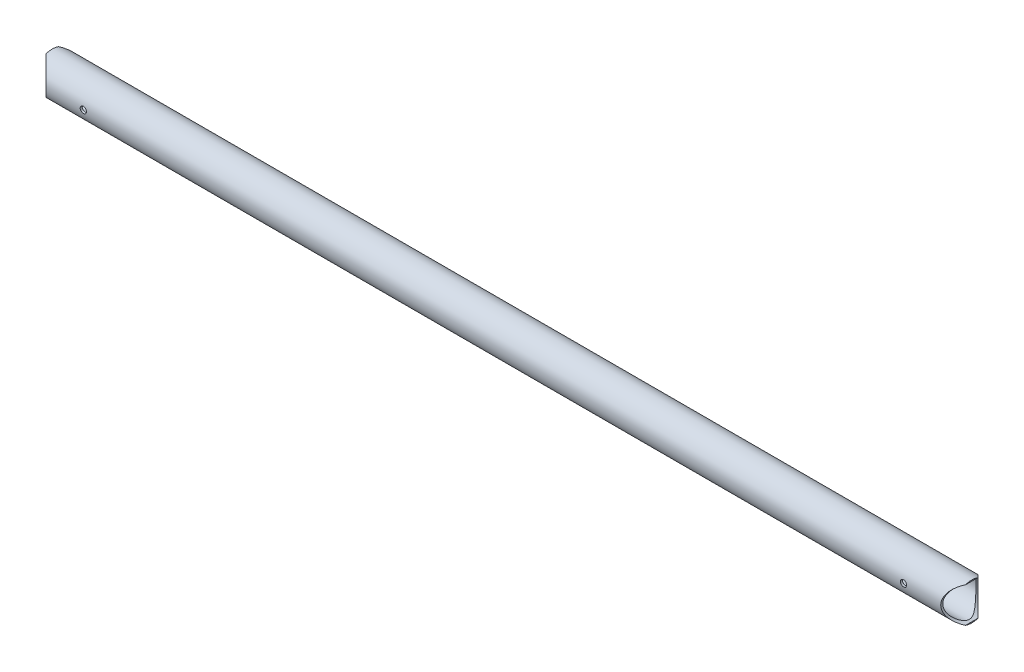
ISO-10303-21;
HEADER;
FILE_DESCRIPTION(('STEP AP214'),'2;1');
FILE_NAME('part.step','',(''),(''),'','','');
FILE_SCHEMA(('AUTOMOTIVE_DESIGN { 1 0 10303 214 1 1 1 1 }'));
ENDSEC;
DATA;
#1=APPLICATION_CONTEXT('core data for automotive mechanical design processes');
#2=APPLICATION_PROTOCOL_DEFINITION('international standard','automotive_design',2000,#1);
#3=PRODUCT_CONTEXT('',#1,'mechanical');
#4=PRODUCT('Part','Part','',(#3));
#5=PRODUCT_RELATED_PRODUCT_CATEGORY('part','',(#4));
#6=PRODUCT_DEFINITION_FORMATION('','',#4);
#7=PRODUCT_DEFINITION_CONTEXT('part definition',#1,'design');
#8=PRODUCT_DEFINITION('design','',#6,#7);
#9=PRODUCT_DEFINITION_SHAPE('','',#8);
#10=(LENGTH_UNIT() NAMED_UNIT(*) SI_UNIT(.MILLI.,.METRE.));
#11=(NAMED_UNIT(*) PLANE_ANGLE_UNIT() SI_UNIT($,.RADIAN.));
#12=(NAMED_UNIT(*) SI_UNIT($,.STERADIAN.) SOLID_ANGLE_UNIT());
#13=UNCERTAINTY_MEASURE_WITH_UNIT(LENGTH_MEASURE(1.E-05),#10,'distance_accuracy_value','');
#14=(GEOMETRIC_REPRESENTATION_CONTEXT(3) GLOBAL_UNCERTAINTY_ASSIGNED_CONTEXT((#13)) GLOBAL_UNIT_ASSIGNED_CONTEXT((#10,
#11,#12)) REPRESENTATION_CONTEXT('',''));
#15=CARTESIAN_POINT('',(0.,0.,0.));
#16=DIRECTION('',(0.,0.,1.));
#17=DIRECTION('',(1.,0.,0.));
#18=AXIS2_PLACEMENT_3D('',#15,#16,#17);
#19=CARTESIAN_POINT('',(469.9,0.,0.));
#20=DIRECTION('',(1.,0.,0.));
#21=DIRECTION('',(0.,0.,-1.));
#22=AXIS2_PLACEMENT_3D('',#19,#20,#21);
#23=PLANE('',#22);
#24=DIRECTION('',(0.,0.,1.));
#25=VECTOR('',#24,1.);
#26=CARTESIAN_POINT('',(469.9,17.9605122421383,-19.05));
#27=LINE('',#26,#25);
#28=CARTESIAN_POINT('',(469.9,17.9605122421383,-6.35000000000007));
#29=VERTEX_POINT('',#28);
#30=CARTESIAN_POINT('',(469.9,17.9605122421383,6.35000000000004));
#31=VERTEX_POINT('',#30);
#32=EDGE_CURVE('E84',#29,#31,#27,.T.);
#33=ORIENTED_EDGE('',*,*,#32,.F.);
#34=CARTESIAN_POINT('',(469.9,0.,0.));
#35=DIRECTION('',(1.,0.,0.));
#36=DIRECTION('',(0.,0.,-1.));
#37=AXIS2_PLACEMENT_3D('',#34,#35,#36);
#38=CIRCLE('',#37,19.05);
#39=EDGE_CURVE('E11',#29,#31,#38,.T.);
#40=ORIENTED_EDGE('',*,*,#39,.T.);
#41=EDGE_LOOP('',(#33,#40));
#42=FACE_BOUND('',#41,.T.);
#43=ADVANCED_FACE('F30',(#42),#23,.T.);
#44=CARTESIAN_POINT('',(-469.9,0.,0.));
#45=DIRECTION('',(1.,0.,0.));
#46=DIRECTION('',(0.,0.,-1.));
#47=AXIS2_PLACEMENT_3D('',#44,#45,#46);
#48=PLANE('',#47);
#49=CARTESIAN_POINT('',(-469.9,0.,0.));
#50=DIRECTION('',(1.,0.,0.));
#51=DIRECTION('',(0.,0.,-1.));
#52=AXIS2_PLACEMENT_3D('',#49,#50,#51);
#53=CIRCLE('',#52,19.05);
#54=CARTESIAN_POINT('',(-469.9,17.9605122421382,-6.3500000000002));
#55=VERTEX_POINT('',#54);
#56=CARTESIAN_POINT('',(-469.9,17.9605122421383,6.35000000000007));
#57=VERTEX_POINT('',#56);
#58=EDGE_CURVE('E91',#55,#57,#53,.T.);
#59=ORIENTED_EDGE('',*,*,#58,.F.);
#60=DIRECTION('',(0.,0.,1.));
#61=VECTOR('',#60,1.);
#62=CARTESIAN_POINT('',(-469.9,17.9605122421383,-19.05));
#63=LINE('',#62,#61);
#64=EDGE_CURVE('E158',#55,#57,#63,.T.);
#65=ORIENTED_EDGE('',*,*,#64,.T.);
#66=EDGE_LOOP('',(#59,#65));
#67=FACE_BOUND('',#66,.T.);
#68=ADVANCED_FACE('F168',(#67),#48,.F.);
#69=DIRECTION('',(0.,0.,1.));
#70=VECTOR('',#69,1.);
#71=CARTESIAN_POINT('',(469.9,-17.9605122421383,-19.05));
#72=LINE('',#71,#70);
#73=CARTESIAN_POINT('',(469.9,-17.9605122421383,6.35000000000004));
#74=VERTEX_POINT('',#73);
#75=CARTESIAN_POINT('',(469.9,-17.9605122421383,-6.35000000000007));
#76=VERTEX_POINT('',#75);
#77=EDGE_CURVE('E81',#74,#76,#72,.F.);
#78=ORIENTED_EDGE('',*,*,#77,.F.);
#79=EDGE_CURVE('E44',#74,#76,#38,.T.);
#80=ORIENTED_EDGE('',*,*,#79,.T.);
#81=EDGE_LOOP('',(#78,#80));
#82=FACE_BOUND('',#81,.T.);
#83=ADVANCED_FACE('F88',(#82),#23,.T.);
#84=CARTESIAN_POINT('',(-469.9,-17.9605122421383,6.35000000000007));
#85=VERTEX_POINT('',#84);
#86=CARTESIAN_POINT('',(-469.9,-17.9605122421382,-6.3500000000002));
#87=VERTEX_POINT('',#86);
#88=EDGE_CURVE('E92',#85,#87,#53,.T.);
#89=ORIENTED_EDGE('',*,*,#88,.F.);
#90=DIRECTION('',(0.,0.,1.));
#91=VECTOR('',#90,1.);
#92=CARTESIAN_POINT('',(-469.9,-17.9605122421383,-19.05));
#93=LINE('',#92,#91);
#94=EDGE_CURVE('E156',#85,#87,#93,.F.);
#95=ORIENTED_EDGE('',*,*,#94,.T.);
#96=EDGE_LOOP('',(#89,#95));
#97=FACE_BOUND('',#96,.T.);
#98=ADVANCED_FACE('F166',(#97),#48,.F.);
#99=CARTESIAN_POINT('',(469.9,0.,0.));
#100=DIRECTION('',(-1.,0.,0.));
#101=DIRECTION('',(0.,0.,1.));
#102=AXIS2_PLACEMENT_3D('',#99,#100,#101);
#103=CYLINDRICAL_SURFACE('',#102,19.05);
#104=CARTESIAN_POINT('',(422.275,0.,-19.05));
#105=CARTESIAN_POINT('',(422.274992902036,0.17702644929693,-19.0499969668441));
#106=CARTESIAN_POINT('',(422.26014446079,0.354149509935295,-19.0475067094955));
#107=CARTESIAN_POINT('',(422.201167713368,0.703427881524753,-19.0378123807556));
#108=CARTESIAN_POINT('',(422.157012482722,0.875578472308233,-19.0306039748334));
#109=CARTESIAN_POINT('',(422.040792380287,1.20980802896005,-19.0122818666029));
#110=CARTESIAN_POINT('',(421.968750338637,1.37189510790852,-19.0011713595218));
#111=CARTESIAN_POINT('',(421.798861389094,1.68166013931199,-18.9762666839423));
#112=CARTESIAN_POINT('',(421.701017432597,1.82933973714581,-18.9624728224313));
#113=CARTESIAN_POINT('',(421.481307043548,2.10753022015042,-18.9335831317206));
#114=CARTESIAN_POINT('',(421.359242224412,2.2378833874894,-18.9184771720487));
#115=CARTESIAN_POINT('',(421.09498208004,2.4763583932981,-18.8887433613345));
#116=CARTESIAN_POINT('',(420.95278548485,2.58447882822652,-18.8741155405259));
#117=CARTESIAN_POINT('',(420.65121487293,2.7760512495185,-18.8468960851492));
#118=CARTESIAN_POINT('',(420.491740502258,2.85934728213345,-18.8343175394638));
#119=CARTESIAN_POINT('',(420.160818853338,2.99790912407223,-18.8127613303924));
#120=CARTESIAN_POINT('',(419.989372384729,3.05317682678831,-18.8037834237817));
#121=CARTESIAN_POINT('',(419.641045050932,3.13361625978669,-18.790545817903));
#122=CARTESIAN_POINT('',(419.464228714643,3.15906026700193,-18.7862434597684));
#123=CARTESIAN_POINT('',(419.108788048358,3.17997424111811,-18.7827150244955));
#124=CARTESIAN_POINT('',(418.930163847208,3.17544632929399,-18.7834885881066));
#125=CARTESIAN_POINT('',(418.57812161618,3.13676677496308,-18.7899856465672));
#126=CARTESIAN_POINT('',(418.404668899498,3.10292099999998,-18.7956580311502));
#127=CARTESIAN_POINT('',(418.065938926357,3.00704648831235,-18.8112335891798));
#128=CARTESIAN_POINT('',(417.900661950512,2.94501678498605,-18.8211369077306));
#129=CARTESIAN_POINT('',(417.58205939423,2.79422510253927,-18.8441136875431));
#130=CARTESIAN_POINT('',(417.428795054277,2.70533611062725,-18.857202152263));
#131=CARTESIAN_POINT('',(417.139241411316,2.50343926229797,-18.8850640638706));
#132=CARTESIAN_POINT('',(417.002953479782,2.39042945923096,-18.8998376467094));
#133=CARTESIAN_POINT('',(416.749450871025,2.14183240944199,-18.9296297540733));
#134=CARTESIAN_POINT('',(416.632493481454,2.00598273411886,-18.944649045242));
#135=CARTESIAN_POINT('',(416.422995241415,1.71644976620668,-18.9730710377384));
#136=CARTESIAN_POINT('',(416.330454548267,1.56276635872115,-18.9864737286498));
#137=CARTESIAN_POINT('',(416.172393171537,1.24168651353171,-19.01017143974));
#138=CARTESIAN_POINT('',(416.106895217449,1.0742786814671,-19.0204638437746));
#139=CARTESIAN_POINT('',(416.005017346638,0.730628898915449,-19.0367602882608));
#140=CARTESIAN_POINT('',(415.968634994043,0.554387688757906,-19.042764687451));
#141=CARTESIAN_POINT('',(415.926369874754,0.200291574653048,-19.0497603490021));
#142=CARTESIAN_POINT('',(415.920133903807,0.0224799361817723,-19.0508096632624));
#143=CARTESIAN_POINT('',(415.937396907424,-0.331647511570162,-19.0479359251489));
#144=CARTESIAN_POINT('',(415.96089473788,-0.50796337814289,-19.0440130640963));
#145=CARTESIAN_POINT('',(416.036664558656,-0.853003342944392,-19.0316717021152));
#146=CARTESIAN_POINT('',(416.088761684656,-1.02176690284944,-19.0232805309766));
#147=CARTESIAN_POINT('',(416.220064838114,-1.34816454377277,-19.0029396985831));
#148=CARTESIAN_POINT('',(416.299272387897,-1.50579799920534,-18.9909898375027));
#149=CARTESIAN_POINT('',(416.483356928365,-1.80699497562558,-18.9647133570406));
#150=CARTESIAN_POINT('',(416.588454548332,-1.95042186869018,-18.9503666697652));
#151=CARTESIAN_POINT('',(416.821032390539,-2.21772935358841,-18.9209485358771));
#152=CARTESIAN_POINT('',(416.948514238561,-2.34160852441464,-18.9058770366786));
#153=CARTESIAN_POINT('',(417.223825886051,-2.56761333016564,-18.8765202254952));
#154=CARTESIAN_POINT('',(417.371852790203,-2.66950032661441,-18.8622446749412));
#155=CARTESIAN_POINT('',(417.683128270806,-2.84696193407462,-18.8362784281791));
#156=CARTESIAN_POINT('',(417.846376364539,-2.92253737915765,-18.8245876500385));
#157=CARTESIAN_POINT('',(418.182792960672,-3.04487368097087,-18.8051878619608));
#158=CARTESIAN_POINT('',(418.355917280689,-3.09175331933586,-18.7974624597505));
#159=CARTESIAN_POINT('',(418.707722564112,-3.15574102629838,-18.7868270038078));
#160=CARTESIAN_POINT('',(418.88640304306,-3.1728516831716,-18.7839165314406));
#161=CARTESIAN_POINT('',(419.241865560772,-3.17674353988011,-18.7832585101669));
#162=CARTESIAN_POINT('',(419.418643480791,-3.16390037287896,-18.7854470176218));
#163=CARTESIAN_POINT('',(419.767485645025,-3.10906139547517,-18.7946002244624));
#164=CARTESIAN_POINT('',(419.939549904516,-3.06706567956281,-18.8015649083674));
#165=CARTESIAN_POINT('',(420.273935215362,-2.9552576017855,-18.8194614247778));
#166=CARTESIAN_POINT('',(420.436267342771,-2.88547758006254,-18.8303886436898));
#167=CARTESIAN_POINT('',(420.746981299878,-2.72012029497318,-18.854983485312));
#168=CARTESIAN_POINT('',(420.895362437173,-2.62454175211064,-18.8686512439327));
#169=CARTESIAN_POINT('',(421.175860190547,-2.4089599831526,-18.8973898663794));
#170=CARTESIAN_POINT('',(421.307762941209,-2.2886804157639,-18.912475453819));
#171=CARTESIAN_POINT('',(421.549641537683,-2.02769346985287,-18.9422325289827));
#172=CARTESIAN_POINT('',(421.659612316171,-1.88698138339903,-18.9569039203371));
#173=CARTESIAN_POINT('',(421.855199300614,-1.58796884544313,-18.9842969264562));
#174=CARTESIAN_POINT('',(421.940642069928,-1.42955364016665,-18.9970043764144));
#175=CARTESIAN_POINT('',(422.083572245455,-1.10047159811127,-19.0188998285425));
#176=CARTESIAN_POINT('',(422.141087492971,-0.929817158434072,-19.028091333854));
#177=CARTESIAN_POINT('',(422.214046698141,-0.632083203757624,-19.0399135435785));
#178=CARTESIAN_POINT('',(422.236867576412,-0.506804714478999,-19.0436757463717));
#179=CARTESIAN_POINT('',(422.267346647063,-0.254367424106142,-19.0487200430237));
#180=CARTESIAN_POINT('',(422.275005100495,-0.127208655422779,-19.0500021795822));
#181=CARTESIAN_POINT('',(422.275,0.,-19.05));
#182=B_SPLINE_CURVE_WITH_KNOTS('',3,(#104,#105,#106,#107,#108,#109,#110,#111,#112,#113,#114,
#115,#116,#117,#118,#119,#120,#121,#122,#123,#124,#125,#126,#127,#128,#129,#130,#131,#132,#133,
#134,#135,#136,#137,#138,#139,#140,#141,#142,#143,#144,#145,#146,#147,#148,#149,#150,#151,#152,
#153,#154,#155,#156,#157,#158,#159,#160,#161,#162,#163,#164,#165,#166,#167,#168,#169,#170,#171,
#172,#173,#174,#175,#176,#177,#178,#179,#180,#181),.UNSPECIFIED.,.T.,.F.,(4,2,2,2,2,2,2,2,2,2,2,
2,2,2,2,2,2,2,2,2,2,2,2,2,2,2,2,2,2,2,2,2,2,2,2,2,2,2,4),(0.,0.530614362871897,1.06171688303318,
1.59238552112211,2.12299348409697,2.65814163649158,3.19332356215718,3.73180001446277,
4.27024008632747,4.80372517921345,5.33717251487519,5.86512062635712,6.39308684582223,
6.92358986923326,7.45413572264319,7.99125617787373,8.52838009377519,9.06595454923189,
9.60348402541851,10.1347001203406,10.6658957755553,11.1938791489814,11.7218921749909,
12.2545706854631,12.7872879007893,13.3255235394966,13.8637421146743,14.3997174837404,
14.9356462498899,15.4648904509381,15.9941329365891,16.5227611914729,17.0514156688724,
17.5863425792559,18.1213929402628,18.6601383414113,19.1983455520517,19.5796439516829,
19.9609357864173),.UNSPECIFIED.);
#183=CARTESIAN_POINT('',(422.275,0.,-19.05));
#184=VERTEX_POINT('',#183);
#185=EDGE_CURVE('E261',#184,#184,#182,.T.);
#186=ORIENTED_EDGE('',*,*,#185,.T.);
#187=EDGE_LOOP('',(#186));
#188=FACE_BOUND('',#187,.T.);
#189=CARTESIAN_POINT('',(422.275,0.,19.05));
#190=CARTESIAN_POINT('',(422.274992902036,-0.17702644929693,19.0499969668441));
#191=CARTESIAN_POINT('',(422.26014446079,-0.354149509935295,19.0475067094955));
#192=CARTESIAN_POINT('',(422.201167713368,-0.703427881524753,19.0378123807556));
#193=CARTESIAN_POINT('',(422.157012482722,-0.875578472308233,19.0306039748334));
#194=CARTESIAN_POINT('',(422.040792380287,-1.20980802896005,19.0122818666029));
#195=CARTESIAN_POINT('',(421.968750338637,-1.37189510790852,19.0011713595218));
#196=CARTESIAN_POINT('',(421.798861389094,-1.68166013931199,18.9762666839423));
#197=CARTESIAN_POINT('',(421.701017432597,-1.82933973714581,18.9624728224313));
#198=CARTESIAN_POINT('',(421.481307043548,-2.10753022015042,18.9335831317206));
#199=CARTESIAN_POINT('',(421.359242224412,-2.2378833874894,18.9184771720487));
#200=CARTESIAN_POINT('',(421.09498208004,-2.4763583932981,18.8887433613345));
#201=CARTESIAN_POINT('',(420.95278548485,-2.58447882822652,18.8741155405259));
#202=CARTESIAN_POINT('',(420.65121487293,-2.7760512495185,18.8468960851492));
#203=CARTESIAN_POINT('',(420.491740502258,-2.85934728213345,18.8343175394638));
#204=CARTESIAN_POINT('',(420.160818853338,-2.99790912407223,18.8127613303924));
#205=CARTESIAN_POINT('',(419.989372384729,-3.05317682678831,18.8037834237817));
#206=CARTESIAN_POINT('',(419.641045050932,-3.13361625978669,18.790545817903));
#207=CARTESIAN_POINT('',(419.464228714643,-3.15906026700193,18.7862434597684));
#208=CARTESIAN_POINT('',(419.108788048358,-3.17997424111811,18.7827150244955));
#209=CARTESIAN_POINT('',(418.930163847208,-3.17544632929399,18.7834885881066));
#210=CARTESIAN_POINT('',(418.57812161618,-3.13676677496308,18.7899856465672));
#211=CARTESIAN_POINT('',(418.404668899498,-3.10292099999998,18.7956580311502));
#212=CARTESIAN_POINT('',(418.065938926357,-3.00704648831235,18.8112335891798));
#213=CARTESIAN_POINT('',(417.900661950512,-2.94501678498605,18.8211369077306));
#214=CARTESIAN_POINT('',(417.58205939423,-2.79422510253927,18.8441136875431));
#215=CARTESIAN_POINT('',(417.428795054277,-2.70533611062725,18.857202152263));
#216=CARTESIAN_POINT('',(417.139241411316,-2.50343926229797,18.8850640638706));
#217=CARTESIAN_POINT('',(417.002953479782,-2.39042945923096,18.8998376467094));
#218=CARTESIAN_POINT('',(416.749450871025,-2.14183240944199,18.9296297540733));
#219=CARTESIAN_POINT('',(416.632493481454,-2.00598273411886,18.944649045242));
#220=CARTESIAN_POINT('',(416.422995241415,-1.71644976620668,18.9730710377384));
#221=CARTESIAN_POINT('',(416.330454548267,-1.56276635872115,18.9864737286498));
#222=CARTESIAN_POINT('',(416.172393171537,-1.24168651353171,19.01017143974));
#223=CARTESIAN_POINT('',(416.106895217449,-1.0742786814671,19.0204638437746));
#224=CARTESIAN_POINT('',(416.005017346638,-0.730628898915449,19.0367602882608));
#225=CARTESIAN_POINT('',(415.968634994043,-0.554387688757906,19.042764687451));
#226=CARTESIAN_POINT('',(415.926369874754,-0.200291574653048,19.0497603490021));
#227=CARTESIAN_POINT('',(415.920133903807,-0.0224799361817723,19.0508096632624));
#228=CARTESIAN_POINT('',(415.937396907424,0.331647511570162,19.0479359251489));
#229=CARTESIAN_POINT('',(415.96089473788,0.50796337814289,19.0440130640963));
#230=CARTESIAN_POINT('',(416.036664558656,0.853003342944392,19.0316717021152));
#231=CARTESIAN_POINT('',(416.088761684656,1.02176690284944,19.0232805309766));
#232=CARTESIAN_POINT('',(416.220064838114,1.34816454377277,19.0029396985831));
#233=CARTESIAN_POINT('',(416.299272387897,1.50579799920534,18.9909898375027));
#234=CARTESIAN_POINT('',(416.483356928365,1.80699497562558,18.9647133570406));
#235=CARTESIAN_POINT('',(416.588454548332,1.95042186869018,18.9503666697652));
#236=CARTESIAN_POINT('',(416.821032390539,2.21772935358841,18.9209485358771));
#237=CARTESIAN_POINT('',(416.948514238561,2.34160852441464,18.9058770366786));
#238=CARTESIAN_POINT('',(417.223825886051,2.56761333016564,18.8765202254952));
#239=CARTESIAN_POINT('',(417.371852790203,2.66950032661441,18.8622446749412));
#240=CARTESIAN_POINT('',(417.683128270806,2.84696193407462,18.8362784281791));
#241=CARTESIAN_POINT('',(417.846376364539,2.92253737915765,18.8245876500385));
#242=CARTESIAN_POINT('',(418.182792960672,3.04487368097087,18.8051878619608));
#243=CARTESIAN_POINT('',(418.355917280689,3.09175331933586,18.7974624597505));
#244=CARTESIAN_POINT('',(418.707722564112,3.15574102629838,18.7868270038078));
#245=CARTESIAN_POINT('',(418.88640304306,3.1728516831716,18.7839165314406));
#246=CARTESIAN_POINT('',(419.241865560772,3.17674353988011,18.7832585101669));
#247=CARTESIAN_POINT('',(419.418643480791,3.16390037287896,18.7854470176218));
#248=CARTESIAN_POINT('',(419.767485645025,3.10906139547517,18.7946002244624));
#249=CARTESIAN_POINT('',(419.939549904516,3.06706567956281,18.8015649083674));
#250=CARTESIAN_POINT('',(420.273935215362,2.9552576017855,18.8194614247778));
#251=CARTESIAN_POINT('',(420.436267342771,2.88547758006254,18.8303886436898));
#252=CARTESIAN_POINT('',(420.746981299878,2.72012029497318,18.854983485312));
#253=CARTESIAN_POINT('',(420.895362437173,2.62454175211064,18.8686512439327));
#254=CARTESIAN_POINT('',(421.175860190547,2.4089599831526,18.8973898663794));
#255=CARTESIAN_POINT('',(421.307762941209,2.2886804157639,18.912475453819));
#256=CARTESIAN_POINT('',(421.549641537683,2.02769346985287,18.9422325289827));
#257=CARTESIAN_POINT('',(421.659612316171,1.88698138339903,18.9569039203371));
#258=CARTESIAN_POINT('',(421.855199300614,1.58796884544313,18.9842969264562));
#259=CARTESIAN_POINT('',(421.940642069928,1.42955364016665,18.9970043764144));
#260=CARTESIAN_POINT('',(422.083572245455,1.10047159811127,19.0188998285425));
#261=CARTESIAN_POINT('',(422.141087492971,0.929817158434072,19.028091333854));
#262=CARTESIAN_POINT('',(422.214046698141,0.632083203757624,19.0399135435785));
#263=CARTESIAN_POINT('',(422.236867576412,0.506804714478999,19.0436757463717));
#264=CARTESIAN_POINT('',(422.267346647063,0.254367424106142,19.0487200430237));
#265=CARTESIAN_POINT('',(422.275005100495,0.127208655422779,19.0500021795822));
#266=CARTESIAN_POINT('',(422.275,0.,19.05));
#267=B_SPLINE_CURVE_WITH_KNOTS('',3,(#189,#190,#191,#192,#193,#194,#195,#196,#197,#198,#199,
#200,#201,#202,#203,#204,#205,#206,#207,#208,#209,#210,#211,#212,#213,#214,#215,#216,#217,#218,
#219,#220,#221,#222,#223,#224,#225,#226,#227,#228,#229,#230,#231,#232,#233,#234,#235,#236,#237,
#238,#239,#240,#241,#242,#243,#244,#245,#246,#247,#248,#249,#250,#251,#252,#253,#254,#255,#256,
#257,#258,#259,#260,#261,#262,#263,#264,#265,#266),.UNSPECIFIED.,.T.,.F.,(4,2,2,2,2,2,2,2,2,2,2,
2,2,2,2,2,2,2,2,2,2,2,2,2,2,2,2,2,2,2,2,2,2,2,2,2,2,2,4),(0.,0.530614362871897,1.06171688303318,
1.59238552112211,2.12299348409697,2.65814163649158,3.19332356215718,3.73180001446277,
4.27024008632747,4.80372517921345,5.33717251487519,5.86512062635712,6.39308684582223,
6.92358986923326,7.45413572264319,7.99125617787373,8.52838009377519,9.06595454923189,
9.60348402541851,10.1347001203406,10.6658957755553,11.1938791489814,11.7218921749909,
12.2545706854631,12.7872879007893,13.3255235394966,13.8637421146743,14.3997174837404,
14.9356462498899,15.4648904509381,15.9941329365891,16.5227611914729,17.0514156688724,
17.5863425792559,18.1213929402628,18.6601383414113,19.1983455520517,19.5796439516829,
19.9609357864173),.UNSPECIFIED.);
#268=CARTESIAN_POINT('',(422.275,0.,19.05));
#269=VERTEX_POINT('',#268);
#270=EDGE_CURVE('E145',#269,#269,#267,.T.);
#271=ORIENTED_EDGE('',*,*,#270,.T.);
#272=EDGE_LOOP('',(#271));
#273=FACE_BOUND('',#272,.T.);
#274=CARTESIAN_POINT('',(-415.925,0.,-19.05));
#275=CARTESIAN_POINT('',(-415.925007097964,0.17702644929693,-19.0499969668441));
#276=CARTESIAN_POINT('',(-415.939855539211,0.354149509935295,-19.0475067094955));
#277=CARTESIAN_POINT('',(-415.998832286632,0.703427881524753,-19.0378123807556));
#278=CARTESIAN_POINT('',(-416.042987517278,0.875578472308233,-19.0306039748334));
#279=CARTESIAN_POINT('',(-416.159207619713,1.20980802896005,-19.0122818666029));
#280=CARTESIAN_POINT('',(-416.231249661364,1.37189510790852,-19.0011713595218));
#281=CARTESIAN_POINT('',(-416.401138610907,1.68166013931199,-18.9762666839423));
#282=CARTESIAN_POINT('',(-416.498982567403,1.82933973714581,-18.9624728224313));
#283=CARTESIAN_POINT('',(-416.718692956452,2.10753022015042,-18.9335831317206));
#284=CARTESIAN_POINT('',(-416.840757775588,2.2378833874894,-18.9184771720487));
#285=CARTESIAN_POINT('',(-417.10501791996,2.4763583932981,-18.8887433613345));
#286=CARTESIAN_POINT('',(-417.24721451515,2.58447882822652,-18.8741155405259));
#287=CARTESIAN_POINT('',(-417.54878512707,2.7760512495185,-18.8468960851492));
#288=CARTESIAN_POINT('',(-417.708259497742,2.85934728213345,-18.8343175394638));
#289=CARTESIAN_POINT('',(-418.039181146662,2.99790912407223,-18.8127613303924));
#290=CARTESIAN_POINT('',(-418.210627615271,3.05317682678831,-18.8037834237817));
#291=CARTESIAN_POINT('',(-418.558954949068,3.13361625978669,-18.790545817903));
#292=CARTESIAN_POINT('',(-418.735771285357,3.15906026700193,-18.7862434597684));
#293=CARTESIAN_POINT('',(-419.091211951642,3.17997424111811,-18.7827150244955));
#294=CARTESIAN_POINT('',(-419.269836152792,3.17544632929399,-18.7834885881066));
#295=CARTESIAN_POINT('',(-419.62187838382,3.13676677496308,-18.7899856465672));
#296=CARTESIAN_POINT('',(-419.795331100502,3.10292099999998,-18.7956580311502));
#297=CARTESIAN_POINT('',(-420.134061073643,3.00704648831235,-18.8112335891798));
#298=CARTESIAN_POINT('',(-420.299338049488,2.94501678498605,-18.8211369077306));
#299=CARTESIAN_POINT('',(-420.61794060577,2.79422510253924,-18.8441136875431));
#300=CARTESIAN_POINT('',(-420.771204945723,2.70533611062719,-18.857202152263));
#301=CARTESIAN_POINT('',(-421.060758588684,2.5034392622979,-18.8850640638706));
#302=CARTESIAN_POINT('',(-421.197046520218,2.39042945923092,-18.8998376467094));
#303=CARTESIAN_POINT('',(-421.450549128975,2.14183240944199,-18.9296297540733));
#304=CARTESIAN_POINT('',(-421.567506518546,2.00598273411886,-18.944649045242));
#305=CARTESIAN_POINT('',(-421.777004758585,1.71644976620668,-18.9730710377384));
#306=CARTESIAN_POINT('',(-421.869545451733,1.56276635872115,-18.9864737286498));
#307=CARTESIAN_POINT('',(-422.027606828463,1.24168651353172,-19.01017143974));
#308=CARTESIAN_POINT('',(-422.093104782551,1.07427868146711,-19.0204638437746));
#309=CARTESIAN_POINT('',(-422.194982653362,0.73062889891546,-19.0367602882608));
#310=CARTESIAN_POINT('',(-422.231365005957,0.554387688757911,-19.042764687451));
#311=CARTESIAN_POINT('',(-422.273630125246,0.200291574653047,-19.0497603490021));
#312=CARTESIAN_POINT('',(-422.279866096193,0.0224799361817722,-19.0508096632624));
#313=CARTESIAN_POINT('',(-422.262603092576,-0.331647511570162,-19.0479359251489));
#314=CARTESIAN_POINT('',(-422.23910526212,-0.50796337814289,-19.0440130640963));
#315=CARTESIAN_POINT('',(-422.163335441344,-0.853003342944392,-19.0316717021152));
#316=CARTESIAN_POINT('',(-422.111238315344,-1.02176690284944,-19.0232805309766));
#317=CARTESIAN_POINT('',(-421.979935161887,-1.34816454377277,-19.0029396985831));
#318=CARTESIAN_POINT('',(-421.900727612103,-1.50579799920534,-18.9909898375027));
#319=CARTESIAN_POINT('',(-421.716643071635,-1.80699497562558,-18.9647133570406));
#320=CARTESIAN_POINT('',(-421.611545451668,-1.95042186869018,-18.9503666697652));
#321=CARTESIAN_POINT('',(-421.378967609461,-2.21772935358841,-18.9209485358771));
#322=CARTESIAN_POINT('',(-421.251485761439,-2.34160852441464,-18.9058770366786));
#323=CARTESIAN_POINT('',(-420.976174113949,-2.56761333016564,-18.8765202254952));
#324=CARTESIAN_POINT('',(-420.828147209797,-2.66950032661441,-18.8622446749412));
#325=CARTESIAN_POINT('',(-420.516871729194,-2.84696193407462,-18.8362784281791));
#326=CARTESIAN_POINT('',(-420.353623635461,-2.92253737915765,-18.8245876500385));
#327=CARTESIAN_POINT('',(-420.017207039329,-3.04487368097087,-18.8051878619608));
#328=CARTESIAN_POINT('',(-419.844082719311,-3.09175331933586,-18.7974624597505));
#329=CARTESIAN_POINT('',(-419.492277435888,-3.15574102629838,-18.7868270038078));
#330=CARTESIAN_POINT('',(-419.31359695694,-3.1728516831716,-18.7839165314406));
#331=CARTESIAN_POINT('',(-418.958134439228,-3.17674353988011,-18.7832585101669));
#332=CARTESIAN_POINT('',(-418.781356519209,-3.16390037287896,-18.7854470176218));
#333=CARTESIAN_POINT('',(-418.432514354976,-3.10906139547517,-18.7946002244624));
#334=CARTESIAN_POINT('',(-418.260450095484,-3.06706567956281,-18.8015649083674));
#335=CARTESIAN_POINT('',(-417.926064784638,-2.9552576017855,-18.8194614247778));
#336=CARTESIAN_POINT('',(-417.763732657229,-2.88547758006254,-18.8303886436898));
#337=CARTESIAN_POINT('',(-417.453018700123,-2.72012029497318,-18.854983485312));
#338=CARTESIAN_POINT('',(-417.304637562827,-2.62454175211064,-18.8686512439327));
#339=CARTESIAN_POINT('',(-417.024139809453,-2.4089599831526,-18.8973898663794));
#340=CARTESIAN_POINT('',(-416.892237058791,-2.2886804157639,-18.912475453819));
#341=CARTESIAN_POINT('',(-416.650358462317,-2.02769346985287,-18.9422325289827));
#342=CARTESIAN_POINT('',(-416.54038768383,-1.88698138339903,-18.9569039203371));
#343=CARTESIAN_POINT('',(-416.344800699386,-1.58796884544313,-18.9842969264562));
#344=CARTESIAN_POINT('',(-416.259357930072,-1.42955364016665,-18.9970043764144));
#345=CARTESIAN_POINT('',(-416.116427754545,-1.10047159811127,-19.0188998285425));
#346=CARTESIAN_POINT('',(-416.058912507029,-0.929817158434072,-19.028091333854));
#347=CARTESIAN_POINT('',(-415.985953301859,-0.632083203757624,-19.0399135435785));
#348=CARTESIAN_POINT('',(-415.963132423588,-0.506804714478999,-19.0436757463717));
#349=CARTESIAN_POINT('',(-415.932653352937,-0.254367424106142,-19.0487200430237));
#350=CARTESIAN_POINT('',(-415.924994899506,-0.127208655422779,-19.0500021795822));
#351=CARTESIAN_POINT('',(-415.925,0.,-19.05));
#352=B_SPLINE_CURVE_WITH_KNOTS('',3,(#274,#275,#276,#277,#278,#279,#280,#281,#282,#283,#284,
#285,#286,#287,#288,#289,#290,#291,#292,#293,#294,#295,#296,#297,#298,#299,#300,#301,#302,#303,
#304,#305,#306,#307,#308,#309,#310,#311,#312,#313,#314,#315,#316,#317,#318,#319,#320,#321,#322,
#323,#324,#325,#326,#327,#328,#329,#330,#331,#332,#333,#334,#335,#336,#337,#338,#339,#340,#341,
#342,#343,#344,#345,#346,#347,#348,#349,#350,#351),.UNSPECIFIED.,.T.,.F.,(4,2,2,2,2,2,2,2,2,2,2,
2,2,2,2,2,2,2,2,2,2,2,2,2,2,2,2,2,2,2,2,2,2,2,2,2,2,2,4),(0.,0.530614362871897,1.06171688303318,
1.59238552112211,2.12299348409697,2.65814163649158,3.19332356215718,3.73180001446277,
4.27024008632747,4.80372517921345,5.33717251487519,5.86512062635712,6.39308684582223,
6.92358986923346,7.45413572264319,7.99125617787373,8.52838009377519,9.06595454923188,
9.60348402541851,10.1347001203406,10.6658957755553,11.1938791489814,11.7218921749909,
12.2545706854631,12.7872879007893,13.3255235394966,13.8637421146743,14.3997174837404,
14.9356462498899,15.4648904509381,15.9941329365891,16.5227611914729,17.0514156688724,
17.5863425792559,18.1213929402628,18.6601383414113,19.1983455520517,19.5796439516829,
19.9609357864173),.UNSPECIFIED.);
#353=CARTESIAN_POINT('',(-415.925,0.,-19.05));
#354=VERTEX_POINT('',#353);
#355=EDGE_CURVE('E139',#354,#354,#352,.T.);
#356=ORIENTED_EDGE('',*,*,#355,.T.);
#357=EDGE_LOOP('',(#356));
#358=FACE_BOUND('',#357,.T.);
#359=CARTESIAN_POINT('',(-415.925,0.,19.05));
#360=CARTESIAN_POINT('',(-415.925007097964,-0.177026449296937,19.0499969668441));
#361=CARTESIAN_POINT('',(-415.939855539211,-0.354149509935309,19.0475067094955));
#362=CARTESIAN_POINT('',(-415.998832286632,-0.703427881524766,19.0378123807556));
#363=CARTESIAN_POINT('',(-416.042987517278,-0.875578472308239,19.0306039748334));
#364=CARTESIAN_POINT('',(-416.159207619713,-1.20980802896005,19.0122818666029));
#365=CARTESIAN_POINT('',(-416.231249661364,-1.37189510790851,19.0011713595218));
#366=CARTESIAN_POINT('',(-416.401138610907,-1.68166013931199,18.9762666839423));
#367=CARTESIAN_POINT('',(-416.498982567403,-1.82933973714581,18.9624728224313));
#368=CARTESIAN_POINT('',(-416.718692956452,-2.10753022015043,18.9335831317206));
#369=CARTESIAN_POINT('',(-416.840757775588,-2.23788338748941,18.9184771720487));
#370=CARTESIAN_POINT('',(-417.105017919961,-2.47635839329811,18.8887433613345));
#371=CARTESIAN_POINT('',(-417.24721451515,-2.58447882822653,18.8741155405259));
#372=CARTESIAN_POINT('',(-417.54878512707,-2.7760512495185,18.8468960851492));
#373=CARTESIAN_POINT('',(-417.708259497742,-2.85934728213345,18.8343175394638));
#374=CARTESIAN_POINT('',(-418.039181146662,-2.99790912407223,18.8127613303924));
#375=CARTESIAN_POINT('',(-418.210627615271,-3.05317682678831,18.8037834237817));
#376=CARTESIAN_POINT('',(-418.558954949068,-3.13361625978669,18.790545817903));
#377=CARTESIAN_POINT('',(-418.735771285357,-3.15906026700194,18.7862434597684));
#378=CARTESIAN_POINT('',(-419.091211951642,-3.17997424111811,18.7827150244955));
#379=CARTESIAN_POINT('',(-419.269836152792,-3.17544632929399,18.7834885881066));
#380=CARTESIAN_POINT('',(-419.62187838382,-3.13676677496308,18.7899856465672));
#381=CARTESIAN_POINT('',(-419.795331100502,-3.10292099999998,18.7956580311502));
#382=CARTESIAN_POINT('',(-420.134061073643,-3.00704648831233,18.8112335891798));
#383=CARTESIAN_POINT('',(-420.299338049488,-2.94501678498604,18.8211369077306));
#384=CARTESIAN_POINT('',(-420.61794060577,-2.79422510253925,18.8441136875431));
#385=CARTESIAN_POINT('',(-420.771204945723,-2.70533611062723,18.857202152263));
#386=CARTESIAN_POINT('',(-421.060758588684,-2.50343926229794,18.8850640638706));
#387=CARTESIAN_POINT('',(-421.197046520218,-2.39042945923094,18.8998376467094));
#388=CARTESIAN_POINT('',(-421.450549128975,-2.14183240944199,18.9296297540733));
#389=CARTESIAN_POINT('',(-421.567506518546,-2.00598273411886,18.944649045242));
#390=CARTESIAN_POINT('',(-421.777004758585,-1.71644976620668,18.9730710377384));
#391=CARTESIAN_POINT('',(-421.869545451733,-1.56276635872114,18.9864737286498));
#392=CARTESIAN_POINT('',(-422.027606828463,-1.24168651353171,19.01017143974));
#393=CARTESIAN_POINT('',(-422.093104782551,-1.07427868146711,19.0204638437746));
#394=CARTESIAN_POINT('',(-422.194982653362,-0.730628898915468,19.0367602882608));
#395=CARTESIAN_POINT('',(-422.231365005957,-0.554387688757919,19.042764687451));
#396=CARTESIAN_POINT('',(-422.273630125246,-0.200291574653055,19.0497603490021));
#397=CARTESIAN_POINT('',(-422.279866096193,-0.0224799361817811,19.0508096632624));
#398=CARTESIAN_POINT('',(-422.262603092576,0.331647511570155,19.0479359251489));
#399=CARTESIAN_POINT('',(-422.23910526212,0.507963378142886,19.0440130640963));
#400=CARTESIAN_POINT('',(-422.163335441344,0.853003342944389,19.0316717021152));
#401=CARTESIAN_POINT('',(-422.111238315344,1.02176690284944,19.0232805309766));
#402=CARTESIAN_POINT('',(-421.979935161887,1.34816454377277,19.0029396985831));
#403=CARTESIAN_POINT('',(-421.900727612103,1.50579799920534,18.9909898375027));
#404=CARTESIAN_POINT('',(-421.716643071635,1.80699497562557,18.9647133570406));
#405=CARTESIAN_POINT('',(-421.611545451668,1.95042186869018,18.9503666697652));
#406=CARTESIAN_POINT('',(-421.378967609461,2.21772935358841,18.9209485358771));
#407=CARTESIAN_POINT('',(-421.251485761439,2.34160852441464,18.9058770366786));
#408=CARTESIAN_POINT('',(-420.976174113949,2.56761333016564,18.8765202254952));
#409=CARTESIAN_POINT('',(-420.828147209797,2.66950032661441,18.8622446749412));
#410=CARTESIAN_POINT('',(-420.516871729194,2.84696193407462,18.8362784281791));
#411=CARTESIAN_POINT('',(-420.353623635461,2.92253737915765,18.8245876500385));
#412=CARTESIAN_POINT('',(-420.017207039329,3.04487368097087,18.8051878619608));
#413=CARTESIAN_POINT('',(-419.844082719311,3.09175331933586,18.7974624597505));
#414=CARTESIAN_POINT('',(-419.492277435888,3.15574102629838,18.7868270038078));
#415=CARTESIAN_POINT('',(-419.31359695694,3.1728516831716,18.7839165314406));
#416=CARTESIAN_POINT('',(-418.958134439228,3.17674353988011,18.7832585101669));
#417=CARTESIAN_POINT('',(-418.781356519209,3.16390037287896,18.7854470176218));
#418=CARTESIAN_POINT('',(-418.432514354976,3.10906139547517,18.7946002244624));
#419=CARTESIAN_POINT('',(-418.260450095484,3.06706567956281,18.8015649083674));
#420=CARTESIAN_POINT('',(-417.926064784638,2.9552576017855,18.8194614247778));
#421=CARTESIAN_POINT('',(-417.763732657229,2.88547758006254,18.8303886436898));
#422=CARTESIAN_POINT('',(-417.453018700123,2.72012029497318,18.854983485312));
#423=CARTESIAN_POINT('',(-417.304637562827,2.62454175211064,18.8686512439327));
#424=CARTESIAN_POINT('',(-417.024139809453,2.4089599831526,18.8973898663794));
#425=CARTESIAN_POINT('',(-416.892237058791,2.2886804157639,18.912475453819));
#426=CARTESIAN_POINT('',(-416.650358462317,2.02769346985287,18.9422325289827));
#427=CARTESIAN_POINT('',(-416.54038768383,1.88698138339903,18.9569039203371));
#428=CARTESIAN_POINT('',(-416.344800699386,1.58796884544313,18.9842969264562));
#429=CARTESIAN_POINT('',(-416.259357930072,1.42955364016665,18.9970043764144));
#430=CARTESIAN_POINT('',(-416.116427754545,1.10047159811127,19.0188998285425));
#431=CARTESIAN_POINT('',(-416.058912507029,0.929817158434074,19.028091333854));
#432=CARTESIAN_POINT('',(-415.985953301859,0.632083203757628,19.0399135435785));
#433=CARTESIAN_POINT('',(-415.963132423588,0.506804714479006,19.0436757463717));
#434=CARTESIAN_POINT('',(-415.932653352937,0.254367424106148,19.0487200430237));
#435=CARTESIAN_POINT('',(-415.924994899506,0.127208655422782,19.0500021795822));
#436=CARTESIAN_POINT('',(-415.925,0.,19.05));
#437=B_SPLINE_CURVE_WITH_KNOTS('',3,(#359,#360,#361,#362,#363,#364,#365,#366,#367,#368,#369,
#370,#371,#372,#373,#374,#375,#376,#377,#378,#379,#380,#381,#382,#383,#384,#385,#386,#387,#388,
#389,#390,#391,#392,#393,#394,#395,#396,#397,#398,#399,#400,#401,#402,#403,#404,#405,#406,#407,
#408,#409,#410,#411,#412,#413,#414,#415,#416,#417,#418,#419,#420,#421,#422,#423,#424,#425,#426,
#427,#428,#429,#430,#431,#432,#433,#434,#435,#436),.UNSPECIFIED.,.T.,.F.,(4,2,2,2,2,2,2,2,2,2,2,
2,2,2,2,2,2,2,2,2,2,2,2,2,2,2,2,2,2,2,2,2,2,2,2,2,2,2,4),(0.,0.530614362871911,1.06171688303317,
1.5923855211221,2.12299348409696,2.65814163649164,3.19332356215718,3.73180001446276,
4.27024008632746,4.8037251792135,5.33717251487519,5.86512062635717,6.39308684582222,
6.92358986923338,7.45413572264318,7.99125617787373,8.52838009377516,9.06595454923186,
9.60348402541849,10.1347001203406,10.6658957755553,11.1938791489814,11.7218921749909,
12.2545706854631,12.7872879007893,13.3255235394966,13.8637421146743,14.3997174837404,
14.9356462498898,15.4648904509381,15.9941329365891,16.5227611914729,17.0514156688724,
17.5863425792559,18.1213929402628,18.6601383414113,19.1983455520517,19.5796439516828,
19.9609357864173),.UNSPECIFIED.);
#438=CARTESIAN_POINT('',(-415.925,0.,19.05));
#439=VERTEX_POINT('',#438);
#440=EDGE_CURVE('E144',#439,#439,#437,.T.);
#441=ORIENTED_EDGE('',*,*,#440,.T.);
#442=EDGE_LOOP('',(#441));
#443=FACE_BOUND('',#442,.T.);
#444=ORIENTED_EDGE('',*,*,#39,.F.);
#445=CARTESIAN_POINT('',(476.25,0.,0.));
#446=DIRECTION('',(-0.707106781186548,0.,0.707106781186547));
#447=DIRECTION('',(-0.707106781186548,0.,-0.707106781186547));
#448=AXIS2_PLACEMENT_3D('',#445,#446,#447);
#449=ELLIPSE('',#448,26.9407683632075,19.05);
#450=EDGE_CURVE('E90',#29,#76,#449,.T.);
#451=ORIENTED_EDGE('',*,*,#450,.T.);
#452=ORIENTED_EDGE('',*,*,#79,.F.);
#453=CARTESIAN_POINT('',(476.25,0.,0.));
#454=DIRECTION('',(-0.707106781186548,0.,-0.707106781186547));
#455=DIRECTION('',(-0.707106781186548,0.,0.707106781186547));
#456=AXIS2_PLACEMENT_3D('',#453,#454,#455);
#457=ELLIPSE('',#456,26.9407683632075,19.05);
#458=EDGE_CURVE('E52',#74,#31,#457,.T.);
#459=ORIENTED_EDGE('',*,*,#458,.T.);
#460=EDGE_LOOP('',(#444,#451,#452,#459));
#461=FACE_BOUND('',#460,.T.);
#462=ORIENTED_EDGE('',*,*,#58,.T.);
#463=CARTESIAN_POINT('',(-476.25,0.,0.));
#464=DIRECTION('',(-0.707106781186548,0.,0.707106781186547));
#465=DIRECTION('',(-0.707106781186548,0.,-0.707106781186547));
#466=AXIS2_PLACEMENT_3D('',#463,#464,#465);
#467=ELLIPSE('',#466,26.9407683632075,19.05);
#468=EDGE_CURVE('E95',#57,#85,#467,.F.);
#469=ORIENTED_EDGE('',*,*,#468,.T.);
#470=ORIENTED_EDGE('',*,*,#88,.T.);
#471=CARTESIAN_POINT('',(-476.25,0.,0.));
#472=DIRECTION('',(-0.707106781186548,0.,-0.707106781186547));
#473=DIRECTION('',(-0.707106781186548,0.,0.707106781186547));
#474=AXIS2_PLACEMENT_3D('',#471,#472,#473);
#475=ELLIPSE('',#474,26.9407683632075,19.05);
#476=EDGE_CURVE('E60',#87,#55,#475,.F.);
#477=ORIENTED_EDGE('',*,*,#476,.T.);
#478=EDGE_LOOP('',(#462,#469,#470,#477));
#479=FACE_BOUND('',#478,.T.);
#480=ADVANCED_FACE('F32',(#188,#273,#358,#443,#461,#479),#103,.T.);
#481=CARTESIAN_POINT('',(469.9,0.,0.));
#482=DIRECTION('',(-1.,0.,0.));
#483=DIRECTION('',(0.,0.,1.));
#484=AXIS2_PLACEMENT_3D('',#481,#482,#483);
#485=CYLINDRICAL_SURFACE('',#484,16.9418);
#486=CARTESIAN_POINT('',(422.275,0.,16.9418));
#487=CARTESIAN_POINT('',(422.274993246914,-0.176683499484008,16.9417968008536));
#488=CARTESIAN_POINT('',(422.260201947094,-0.353454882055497,16.9390075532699));
#489=CARTESIAN_POINT('',(422.201465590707,-0.702016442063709,16.9281495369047));
#490=CARTESIAN_POINT('',(422.157495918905,-0.873802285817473,16.9200763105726));
#491=CARTESIAN_POINT('',(422.041796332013,-1.20730139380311,16.8995534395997));
#492=CARTESIAN_POINT('',(421.970091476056,-1.36902359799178,16.8871077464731));
#493=CARTESIAN_POINT('',(421.801028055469,-1.67812706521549,16.8591990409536));
#494=CARTESIAN_POINT('',(421.703671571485,-1.82550949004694,16.8437362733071));
#495=CARTESIAN_POINT('',(421.48483202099,-2.10352797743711,16.81129331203));
#496=CARTESIAN_POINT('',(421.363101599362,-2.2339676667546,16.7942986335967));
#497=CARTESIAN_POINT('',(421.099501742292,-2.47269917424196,16.7608147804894));
#498=CARTESIAN_POINT('',(420.957630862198,-2.58098940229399,16.7443256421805));
#499=CARTESIAN_POINT('',(420.656389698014,-2.77316464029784,16.7135790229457));
#500=CARTESIAN_POINT('',(420.496889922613,-2.85684991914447,16.699340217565));
#501=CARTESIAN_POINT('',(420.165783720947,-2.99616114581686,16.6749104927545));
#502=CARTESIAN_POINT('',(419.994178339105,-3.05178951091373,16.6647192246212));
#503=CARTESIAN_POINT('',(419.645833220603,-3.13277765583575,16.6496842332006));
#504=CARTESIAN_POINT('',(419.469175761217,-3.15847988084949,16.6447800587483));
#505=CARTESIAN_POINT('',(419.113993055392,-3.17994907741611,16.6406922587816));
#506=CARTESIAN_POINT('',(418.935467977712,-3.17571873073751,16.6415081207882));
#507=CARTESIAN_POINT('',(418.584098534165,-3.13772055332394,16.6487131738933));
#508=CARTESIAN_POINT('',(418.411210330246,-3.10434210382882,16.6550288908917));
#509=CARTESIAN_POINT('',(418.073531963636,-3.00960841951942,16.6724066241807));
#510=CARTESIAN_POINT('',(417.908742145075,-2.94825199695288,16.6834688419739));
#511=CARTESIAN_POINT('',(417.590798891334,-2.79892318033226,16.709169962));
#512=CARTESIAN_POINT('',(417.43772108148,-2.71079353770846,16.7238298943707));
#513=CARTESIAN_POINT('',(417.148379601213,-2.51053117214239,16.7550607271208));
#514=CARTESIAN_POINT('',(417.012117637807,-2.39839601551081,16.7716318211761));
#515=CARTESIAN_POINT('',(416.758026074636,-2.15120625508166,16.805137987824));
#516=CARTESIAN_POINT('',(416.640520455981,-2.01581859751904,16.8220746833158));
#517=CARTESIAN_POINT('',(416.429840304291,-1.72708151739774,16.8541639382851));
#518=CARTESIAN_POINT('',(416.336666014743,-1.5737319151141,16.8693164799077));
#519=CARTESIAN_POINT('',(416.177245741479,-1.25308617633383,16.8961606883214));
#520=CARTESIAN_POINT('',(416.11103343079,-1.08577291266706,16.9078480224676));
#521=CARTESIAN_POINT('',(416.007744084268,-0.742131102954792,16.9264114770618));
#522=CARTESIAN_POINT('',(415.970663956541,-0.565803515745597,16.9332881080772));
#523=CARTESIAN_POINT('',(415.927142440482,-0.211925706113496,16.9413852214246));
#524=CARTESIAN_POINT('',(415.920257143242,-0.0344318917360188,16.9426876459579));
#525=CARTESIAN_POINT('',(415.936130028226,0.319170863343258,16.9397159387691));
#526=CARTESIAN_POINT('',(415.958886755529,0.495279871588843,16.9354420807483));
#527=CARTESIAN_POINT('',(416.03302865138,0.839706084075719,16.9218490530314));
#528=CARTESIAN_POINT('',(416.084189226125,1.008073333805,16.912569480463));
#529=CARTESIAN_POINT('',(416.213443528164,1.33384060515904,16.8900012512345));
#530=CARTESIAN_POINT('',(416.29153908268,1.49123988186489,16.8767123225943));
#531=CARTESIAN_POINT('',(416.473429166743,1.79249785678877,16.8473950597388));
#532=CARTESIAN_POINT('',(416.577494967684,1.93618995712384,16.8313384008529));
#533=CARTESIAN_POINT('',(416.808004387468,2.20423073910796,16.7983399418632));
#534=CARTESIAN_POINT('',(416.934450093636,2.32857761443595,16.7813980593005));
#535=CARTESIAN_POINT('',(417.208139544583,2.55608476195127,16.748266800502));
#536=CARTESIAN_POINT('',(417.355636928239,2.65894211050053,16.7320903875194));
#537=CARTESIAN_POINT('',(417.666077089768,2.83842073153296,16.7025824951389));
#538=CARTESIAN_POINT('',(417.829019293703,2.91504297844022,16.6892509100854));
#539=CARTESIAN_POINT('',(418.164954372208,3.03944680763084,16.6670438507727));
#540=CARTESIAN_POINT('',(418.33789432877,3.08736728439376,16.658146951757));
#541=CARTESIAN_POINT('',(418.689553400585,3.15343564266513,16.6457676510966));
#542=CARTESIAN_POINT('',(418.868271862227,3.17158687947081,16.6422846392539));
#543=CARTESIAN_POINT('',(419.223380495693,3.17748933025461,16.6411583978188));
#544=CARTESIAN_POINT('',(419.399762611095,3.16571837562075,16.6434233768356));
#545=CARTESIAN_POINT('',(419.747986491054,3.1131566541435,16.6533343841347));
#546=CARTESIAN_POINT('',(419.919828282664,3.07236606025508,16.6609803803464));
#547=CARTESIAN_POINT('',(420.253836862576,2.96312447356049,16.6807532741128));
#548=CARTESIAN_POINT('',(420.416021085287,2.89472517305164,16.6928717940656));
#549=CARTESIAN_POINT('',(420.726688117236,2.73226003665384,16.7202302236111));
#550=CARTESIAN_POINT('',(420.875169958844,2.63819238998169,16.7354703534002));
#551=CARTESIAN_POINT('',(421.156610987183,2.42539938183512,16.767639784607));
#552=CARTESIAN_POINT('',(421.289304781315,2.30632625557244,16.7845909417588));
#553=CARTESIAN_POINT('',(421.532987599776,2.04762748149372,16.8181088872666));
#554=CARTESIAN_POINT('',(421.64397163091,1.90799711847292,16.8346755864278));
#555=CARTESIAN_POINT('',(421.842016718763,1.61064321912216,16.8657327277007));
#556=CARTESIAN_POINT('',(421.928853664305,1.4527682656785,16.8802031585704));
#557=CARTESIAN_POINT('',(422.074632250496,1.12444948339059,16.9052419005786));
#558=CARTESIAN_POINT('',(422.133600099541,0.954017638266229,16.9158138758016));
#559=CARTESIAN_POINT('',(422.209990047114,0.652570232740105,16.929708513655));
#560=CARTESIAN_POINT('',(422.234327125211,0.523317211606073,16.9342172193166));
#561=CARTESIAN_POINT('',(422.266834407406,0.262725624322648,16.9402641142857));
#562=CARTESIAN_POINT('',(422.275005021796,0.131387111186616,16.9418023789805));
#563=CARTESIAN_POINT('',(422.275,0.,16.9418));
#564=B_SPLINE_CURVE_WITH_KNOTS('',3,(#486,#487,#488,#489,#490,#491,#492,#493,#494,#495,#496,
#497,#498,#499,#500,#501,#502,#503,#504,#505,#506,#507,#508,#509,#510,#511,#512,#513,#514,#515,
#516,#517,#518,#519,#520,#521,#522,#523,#524,#525,#526,#527,#528,#529,#530,#531,#532,#533,#534,
#535,#536,#537,#538,#539,#540,#541,#542,#543,#544,#545,#546,#547,#548,#549,#550,#551,#552,#553,
#554,#555,#556,#557,#558,#559,#560,#561,#562,#563),.UNSPECIFIED.,.T.,.F.,(4,2,2,2,2,2,2,2,2,2,2,
2,2,2,2,2,2,2,2,2,2,2,2,2,2,2,2,2,2,2,2,2,2,2,2,2,2,2,4),(0.,0.529570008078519,1.05958733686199,
1.58912690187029,2.11862352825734,2.65379410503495,3.18900308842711,3.728443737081,
4.26783790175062,4.80099715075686,5.33410863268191,5.86020553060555,6.38632476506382,
6.91559586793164,7.44492065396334,7.98257927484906,8.52024327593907,9.0585767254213,
9.59685303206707,10.1271887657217,10.6574984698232,11.1836734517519,11.7098841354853,
12.241839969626,12.7738454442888,13.31290804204,13.851950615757,14.3883631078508,
14.924715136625,15.4525560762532,15.9803938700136,16.5072479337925,17.0341391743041,
17.5689112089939,18.1038060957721,18.6435112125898,19.1827077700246,19.5765217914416,
19.9703258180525),.UNSPECIFIED.);
#565=CARTESIAN_POINT('',(422.275,0.,16.9418));
#566=VERTEX_POINT('',#565);
#567=EDGE_CURVE('E35',#566,#566,#564,.T.);
#568=ORIENTED_EDGE('',*,*,#567,.F.);
#569=EDGE_LOOP('',(#568));
#570=FACE_BOUND('',#569,.T.);
#571=CARTESIAN_POINT('',(422.275,0.,-16.9418));
#572=CARTESIAN_POINT('',(422.274993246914,0.176683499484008,-16.9417968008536));
#573=CARTESIAN_POINT('',(422.260201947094,0.353454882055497,-16.9390075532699));
#574=CARTESIAN_POINT('',(422.201465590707,0.702016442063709,-16.9281495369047));
#575=CARTESIAN_POINT('',(422.157495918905,0.873802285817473,-16.9200763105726));
#576=CARTESIAN_POINT('',(422.041796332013,1.20730139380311,-16.8995534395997));
#577=CARTESIAN_POINT('',(421.970091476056,1.36902359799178,-16.8871077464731));
#578=CARTESIAN_POINT('',(421.801028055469,1.67812706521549,-16.8591990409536));
#579=CARTESIAN_POINT('',(421.703671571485,1.82550949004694,-16.8437362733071));
#580=CARTESIAN_POINT('',(421.48483202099,2.10352797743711,-16.81129331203));
#581=CARTESIAN_POINT('',(421.363101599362,2.2339676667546,-16.7942986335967));
#582=CARTESIAN_POINT('',(421.099501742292,2.47269917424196,-16.7608147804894));
#583=CARTESIAN_POINT('',(420.957630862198,2.58098940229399,-16.7443256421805));
#584=CARTESIAN_POINT('',(420.656389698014,2.77316464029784,-16.7135790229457));
#585=CARTESIAN_POINT('',(420.496889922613,2.85684991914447,-16.699340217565));
#586=CARTESIAN_POINT('',(420.165783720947,2.99616114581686,-16.6749104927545));
#587=CARTESIAN_POINT('',(419.994178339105,3.05178951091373,-16.6647192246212));
#588=CARTESIAN_POINT('',(419.645833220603,3.13277765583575,-16.6496842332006));
#589=CARTESIAN_POINT('',(419.469175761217,3.15847988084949,-16.6447800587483));
#590=CARTESIAN_POINT('',(419.113993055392,3.17994907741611,-16.6406922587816));
#591=CARTESIAN_POINT('',(418.935467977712,3.17571873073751,-16.6415081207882));
#592=CARTESIAN_POINT('',(418.584098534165,3.13772055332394,-16.6487131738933));
#593=CARTESIAN_POINT('',(418.411210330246,3.10434210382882,-16.6550288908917));
#594=CARTESIAN_POINT('',(418.073531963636,3.00960841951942,-16.6724066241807));
#595=CARTESIAN_POINT('',(417.908742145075,2.94825199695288,-16.6834688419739));
#596=CARTESIAN_POINT('',(417.590798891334,2.79892318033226,-16.709169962));
#597=CARTESIAN_POINT('',(417.43772108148,2.71079353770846,-16.7238298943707));
#598=CARTESIAN_POINT('',(417.148379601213,2.51053117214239,-16.7550607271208));
#599=CARTESIAN_POINT('',(417.012117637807,2.39839601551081,-16.7716318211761));
#600=CARTESIAN_POINT('',(416.758026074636,2.15120625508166,-16.805137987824));
#601=CARTESIAN_POINT('',(416.640520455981,2.01581859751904,-16.8220746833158));
#602=CARTESIAN_POINT('',(416.429840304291,1.72708151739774,-16.8541639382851));
#603=CARTESIAN_POINT('',(416.336666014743,1.5737319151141,-16.8693164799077));
#604=CARTESIAN_POINT('',(416.177245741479,1.25308617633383,-16.8961606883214));
#605=CARTESIAN_POINT('',(416.11103343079,1.08577291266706,-16.9078480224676));
#606=CARTESIAN_POINT('',(416.007744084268,0.742131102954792,-16.9264114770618));
#607=CARTESIAN_POINT('',(415.970663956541,0.565803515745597,-16.9332881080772));
#608=CARTESIAN_POINT('',(415.927142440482,0.211925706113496,-16.9413852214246));
#609=CARTESIAN_POINT('',(415.920257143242,0.0344318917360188,-16.9426876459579));
#610=CARTESIAN_POINT('',(415.936130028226,-0.319170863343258,-16.9397159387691));
#611=CARTESIAN_POINT('',(415.958886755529,-0.495279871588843,-16.9354420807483));
#612=CARTESIAN_POINT('',(416.03302865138,-0.839706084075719,-16.9218490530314));
#613=CARTESIAN_POINT('',(416.084189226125,-1.008073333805,-16.912569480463));
#614=CARTESIAN_POINT('',(416.213443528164,-1.33384060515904,-16.8900012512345));
#615=CARTESIAN_POINT('',(416.29153908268,-1.49123988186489,-16.8767123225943));
#616=CARTESIAN_POINT('',(416.473429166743,-1.79249785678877,-16.8473950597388));
#617=CARTESIAN_POINT('',(416.577494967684,-1.93618995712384,-16.8313384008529));
#618=CARTESIAN_POINT('',(416.808004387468,-2.20423073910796,-16.7983399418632));
#619=CARTESIAN_POINT('',(416.934450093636,-2.32857761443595,-16.7813980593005));
#620=CARTESIAN_POINT('',(417.208139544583,-2.55608476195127,-16.748266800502));
#621=CARTESIAN_POINT('',(417.355636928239,-2.65894211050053,-16.7320903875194));
#622=CARTESIAN_POINT('',(417.666077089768,-2.83842073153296,-16.7025824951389));
#623=CARTESIAN_POINT('',(417.829019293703,-2.91504297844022,-16.6892509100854));
#624=CARTESIAN_POINT('',(418.164954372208,-3.03944680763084,-16.6670438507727));
#625=CARTESIAN_POINT('',(418.33789432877,-3.08736728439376,-16.658146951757));
#626=CARTESIAN_POINT('',(418.689553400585,-3.15343564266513,-16.6457676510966));
#627=CARTESIAN_POINT('',(418.868271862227,-3.17158687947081,-16.6422846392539));
#628=CARTESIAN_POINT('',(419.223380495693,-3.17748933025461,-16.6411583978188));
#629=CARTESIAN_POINT('',(419.399762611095,-3.16571837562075,-16.6434233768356));
#630=CARTESIAN_POINT('',(419.747986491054,-3.1131566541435,-16.6533343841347));
#631=CARTESIAN_POINT('',(419.919828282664,-3.07236606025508,-16.6609803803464));
#632=CARTESIAN_POINT('',(420.253836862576,-2.96312447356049,-16.6807532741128));
#633=CARTESIAN_POINT('',(420.416021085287,-2.89472517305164,-16.6928717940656));
#634=CARTESIAN_POINT('',(420.726688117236,-2.73226003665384,-16.7202302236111));
#635=CARTESIAN_POINT('',(420.875169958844,-2.63819238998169,-16.7354703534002));
#636=CARTESIAN_POINT('',(421.156610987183,-2.42539938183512,-16.767639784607));
#637=CARTESIAN_POINT('',(421.289304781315,-2.30632625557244,-16.7845909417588));
#638=CARTESIAN_POINT('',(421.532987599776,-2.04762748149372,-16.8181088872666));
#639=CARTESIAN_POINT('',(421.64397163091,-1.90799711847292,-16.8346755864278));
#640=CARTESIAN_POINT('',(421.842016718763,-1.61064321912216,-16.8657327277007));
#641=CARTESIAN_POINT('',(421.928853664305,-1.4527682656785,-16.8802031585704));
#642=CARTESIAN_POINT('',(422.074632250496,-1.12444948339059,-16.9052419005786));
#643=CARTESIAN_POINT('',(422.133600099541,-0.954017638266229,-16.9158138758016));
#644=CARTESIAN_POINT('',(422.209990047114,-0.652570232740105,-16.929708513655));
#645=CARTESIAN_POINT('',(422.234327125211,-0.523317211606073,-16.9342172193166));
#646=CARTESIAN_POINT('',(422.266834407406,-0.262725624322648,-16.9402641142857));
#647=CARTESIAN_POINT('',(422.275005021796,-0.131387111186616,-16.9418023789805));
#648=CARTESIAN_POINT('',(422.275,0.,-16.9418));
#649=B_SPLINE_CURVE_WITH_KNOTS('',3,(#571,#572,#573,#574,#575,#576,#577,#578,#579,#580,#581,
#582,#583,#584,#585,#586,#587,#588,#589,#590,#591,#592,#593,#594,#595,#596,#597,#598,#599,#600,
#601,#602,#603,#604,#605,#606,#607,#608,#609,#610,#611,#612,#613,#614,#615,#616,#617,#618,#619,
#620,#621,#622,#623,#624,#625,#626,#627,#628,#629,#630,#631,#632,#633,#634,#635,#636,#637,#638,
#639,#640,#641,#642,#643,#644,#645,#646,#647,#648),.UNSPECIFIED.,.T.,.F.,(4,2,2,2,2,2,2,2,2,2,2,
2,2,2,2,2,2,2,2,2,2,2,2,2,2,2,2,2,2,2,2,2,2,2,2,2,2,2,4),(0.,0.529570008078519,1.05958733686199,
1.58912690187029,2.11862352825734,2.65379410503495,3.18900308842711,3.728443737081,
4.26783790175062,4.80099715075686,5.33410863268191,5.86020553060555,6.38632476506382,
6.91559586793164,7.44492065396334,7.98257927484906,8.52024327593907,9.0585767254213,
9.59685303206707,10.1271887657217,10.6574984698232,11.1836734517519,11.7098841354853,
12.241839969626,12.7738454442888,13.31290804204,13.851950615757,14.3883631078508,
14.924715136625,15.4525560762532,15.9803938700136,16.5072479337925,17.0341391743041,
17.5689112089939,18.1038060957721,18.6435112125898,19.1827077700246,19.5765217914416,
19.9703258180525),.UNSPECIFIED.);
#650=CARTESIAN_POINT('',(422.275,0.,-16.9418));
#651=VERTEX_POINT('',#650);
#652=EDGE_CURVE('E265',#651,#651,#649,.T.);
#653=ORIENTED_EDGE('',*,*,#652,.F.);
#654=EDGE_LOOP('',(#653));
#655=FACE_BOUND('',#654,.T.);
#656=CARTESIAN_POINT('',(-415.925,0.,16.9418));
#657=CARTESIAN_POINT('',(-415.925006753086,-0.176683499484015,16.9417968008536));
#658=CARTESIAN_POINT('',(-415.939798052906,-0.35345488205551,16.9390075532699));
#659=CARTESIAN_POINT('',(-415.998534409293,-0.702016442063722,16.9281495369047));
#660=CARTESIAN_POINT('',(-416.042504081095,-0.873802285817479,16.9200763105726));
#661=CARTESIAN_POINT('',(-416.158203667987,-1.20730139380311,16.8995534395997));
#662=CARTESIAN_POINT('',(-416.229908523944,-1.36902359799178,16.8871077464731));
#663=CARTESIAN_POINT('',(-416.398971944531,-1.67812706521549,16.8591990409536));
#664=CARTESIAN_POINT('',(-416.496328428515,-1.82550949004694,16.8437362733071));
#665=CARTESIAN_POINT('',(-416.71516797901,-2.10352797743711,16.81129331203));
#666=CARTESIAN_POINT('',(-416.836898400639,-2.2339676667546,16.7942986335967));
#667=CARTESIAN_POINT('',(-417.100498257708,-2.47269917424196,16.7608147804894));
#668=CARTESIAN_POINT('',(-417.242369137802,-2.58098940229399,16.7443256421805));
#669=CARTESIAN_POINT('',(-417.543610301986,-2.77316464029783,16.7135790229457));
#670=CARTESIAN_POINT('',(-417.703110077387,-2.85684991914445,16.699340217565));
#671=CARTESIAN_POINT('',(-418.034216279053,-2.99616114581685,16.6749104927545));
#672=CARTESIAN_POINT('',(-418.205821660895,-3.05178951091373,16.6647192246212));
#673=CARTESIAN_POINT('',(-418.554166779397,-3.13277765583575,16.6496842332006));
#674=CARTESIAN_POINT('',(-418.730824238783,-3.15847988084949,16.6447800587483));
#675=CARTESIAN_POINT('',(-419.086006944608,-3.17994907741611,16.6406922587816));
#676=CARTESIAN_POINT('',(-419.264532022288,-3.17571873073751,16.6415081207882));
#677=CARTESIAN_POINT('',(-419.615901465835,-3.13772055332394,16.6487131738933));
#678=CARTESIAN_POINT('',(-419.788789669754,-3.10434210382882,16.6550288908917));
#679=CARTESIAN_POINT('',(-420.126468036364,-3.00960841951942,16.6724066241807));
#680=CARTESIAN_POINT('',(-420.291257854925,-2.94825199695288,16.6834688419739));
#681=CARTESIAN_POINT('',(-420.609201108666,-2.79892318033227,16.709169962));
#682=CARTESIAN_POINT('',(-420.76227891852,-2.71079353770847,16.7238298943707));
#683=CARTESIAN_POINT('',(-421.051620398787,-2.51053117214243,16.7550607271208));
#684=CARTESIAN_POINT('',(-421.187882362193,-2.39839601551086,16.7716318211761));
#685=CARTESIAN_POINT('',(-421.441973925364,-2.15120625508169,16.805137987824));
#686=CARTESIAN_POINT('',(-421.559479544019,-2.01581859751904,16.8220746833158));
#687=CARTESIAN_POINT('',(-421.770159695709,-1.72708151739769,16.8541639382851));
#688=CARTESIAN_POINT('',(-421.863333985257,-1.57373191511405,16.8693164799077));
#689=CARTESIAN_POINT('',(-422.022754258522,-1.25308617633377,16.8961606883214));
#690=CARTESIAN_POINT('',(-422.08896656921,-1.08577291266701,16.9078480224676));
#691=CARTESIAN_POINT('',(-422.192255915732,-0.742131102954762,16.9264114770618));
#692=CARTESIAN_POINT('',(-422.229336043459,-0.565803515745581,16.9332881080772));
#693=CARTESIAN_POINT('',(-422.272857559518,-0.211925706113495,16.9413852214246));
#694=CARTESIAN_POINT('',(-422.279742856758,-0.0344318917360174,16.9426876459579));
#695=CARTESIAN_POINT('',(-422.263869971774,0.319170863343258,16.9397159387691));
#696=CARTESIAN_POINT('',(-422.241113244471,0.495279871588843,16.9354420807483));
#697=CARTESIAN_POINT('',(-422.16697134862,0.839706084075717,16.9218490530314));
#698=CARTESIAN_POINT('',(-422.115810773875,1.008073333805,16.912569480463));
#699=CARTESIAN_POINT('',(-421.986556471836,1.33384060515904,16.8900012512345));
#700=CARTESIAN_POINT('',(-421.90846091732,1.49123988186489,16.8767123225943));
#701=CARTESIAN_POINT('',(-421.726570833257,1.79249785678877,16.8473950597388));
#702=CARTESIAN_POINT('',(-421.622505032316,1.93618995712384,16.8313384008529));
#703=CARTESIAN_POINT('',(-421.391995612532,2.20423073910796,16.7983399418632));
#704=CARTESIAN_POINT('',(-421.265549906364,2.32857761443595,16.7813980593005));
#705=CARTESIAN_POINT('',(-420.991860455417,2.55608476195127,16.748266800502));
#706=CARTESIAN_POINT('',(-420.844363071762,2.65894211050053,16.7320903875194));
#707=CARTESIAN_POINT('',(-420.533922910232,2.83842073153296,16.7025824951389));
#708=CARTESIAN_POINT('',(-420.370980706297,2.91504297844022,16.6892509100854));
#709=CARTESIAN_POINT('',(-420.035045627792,3.03944680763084,16.6670438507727));
#710=CARTESIAN_POINT('',(-419.86210567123,3.08736728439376,16.658146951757));
#711=CARTESIAN_POINT('',(-419.510446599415,3.15343564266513,16.6457676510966));
#712=CARTESIAN_POINT('',(-419.331728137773,3.17158687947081,16.6422846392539));
#713=CARTESIAN_POINT('',(-418.976619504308,3.17748933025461,16.6411583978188));
#714=CARTESIAN_POINT('',(-418.800237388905,3.16571837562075,16.6434233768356));
#715=CARTESIAN_POINT('',(-418.452013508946,3.1131566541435,16.6533343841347));
#716=CARTESIAN_POINT('',(-418.280171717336,3.07236606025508,16.6609803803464));
#717=CARTESIAN_POINT('',(-417.946163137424,2.96312447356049,16.6807532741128));
#718=CARTESIAN_POINT('',(-417.783978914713,2.89472517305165,16.6928717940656));
#719=CARTESIAN_POINT('',(-417.473311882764,2.73226003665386,16.7202302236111));
#720=CARTESIAN_POINT('',(-417.324830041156,2.6381923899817,16.7354703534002));
#721=CARTESIAN_POINT('',(-417.043389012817,2.42539938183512,16.767639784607));
#722=CARTESIAN_POINT('',(-416.910695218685,2.30632625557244,16.7845909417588));
#723=CARTESIAN_POINT('',(-416.667012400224,2.04762748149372,16.8181088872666));
#724=CARTESIAN_POINT('',(-416.55602836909,1.90799711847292,16.8346755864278));
#725=CARTESIAN_POINT('',(-416.357983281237,1.61064321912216,16.8657327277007));
#726=CARTESIAN_POINT('',(-416.271146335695,1.4527682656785,16.8802031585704));
#727=CARTESIAN_POINT('',(-416.125367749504,1.12444948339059,16.9052419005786));
#728=CARTESIAN_POINT('',(-416.066399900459,0.95401763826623,16.9158138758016));
#729=CARTESIAN_POINT('',(-415.990009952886,0.652570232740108,16.929708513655));
#730=CARTESIAN_POINT('',(-415.965672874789,0.523317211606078,16.9342172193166));
#731=CARTESIAN_POINT('',(-415.933165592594,0.262725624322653,16.9402641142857));
#732=CARTESIAN_POINT('',(-415.924994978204,0.131387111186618,16.9418023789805));
#733=CARTESIAN_POINT('',(-415.925,0.,16.9418));
#734=B_SPLINE_CURVE_WITH_KNOTS('',3,(#656,#657,#658,#659,#660,#661,#662,#663,#664,#665,#666,
#667,#668,#669,#670,#671,#672,#673,#674,#675,#676,#677,#678,#679,#680,#681,#682,#683,#684,#685,
#686,#687,#688,#689,#690,#691,#692,#693,#694,#695,#696,#697,#698,#699,#700,#701,#702,#703,#704,
#705,#706,#707,#708,#709,#710,#711,#712,#713,#714,#715,#716,#717,#718,#719,#720,#721,#722,#723,
#724,#725,#726,#727,#728,#729,#730,#731,#732,#733),.UNSPECIFIED.,.T.,.F.,(4,2,2,2,2,2,2,2,2,2,2,
2,2,2,2,2,2,2,2,2,2,2,2,2,2,2,2,2,2,2,2,2,2,2,2,2,2,2,4),(0.,0.529570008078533,1.05958733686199,
1.58912690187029,2.11862352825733,2.65379410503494,3.18900308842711,3.72844373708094,
4.26783790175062,4.80099715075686,5.3341086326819,5.86020553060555,6.38632476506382,
6.91559586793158,7.44492065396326,7.98257927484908,8.52024327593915,9.05857672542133,
9.59685303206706,10.1271887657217,10.6574984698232,11.1836734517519,11.7098841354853,
12.241839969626,12.7738454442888,13.31290804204,13.851950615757,14.3883631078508,
14.924715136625,15.4525560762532,15.9803938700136,16.5072479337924,17.0341391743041,
17.5689112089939,18.1038060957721,18.6435112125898,19.1827077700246,19.5765217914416,
19.9703258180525),.UNSPECIFIED.);
#735=CARTESIAN_POINT('',(-415.925,0.,16.9418));
#736=VERTEX_POINT('',#735);
#737=EDGE_CURVE('E135',#736,#736,#734,.T.);
#738=ORIENTED_EDGE('',*,*,#737,.F.);
#739=EDGE_LOOP('',(#738));
#740=FACE_BOUND('',#739,.T.);
#741=CARTESIAN_POINT('',(-415.925,0.,-16.9418));
#742=CARTESIAN_POINT('',(-415.925006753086,0.176683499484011,-16.9417968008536));
#743=CARTESIAN_POINT('',(-415.939798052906,0.353454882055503,-16.9390075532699));
#744=CARTESIAN_POINT('',(-415.998534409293,0.702016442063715,-16.9281495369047));
#745=CARTESIAN_POINT('',(-416.042504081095,0.873802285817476,-16.9200763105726));
#746=CARTESIAN_POINT('',(-416.158203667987,1.20730139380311,-16.8995534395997));
#747=CARTESIAN_POINT('',(-416.229908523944,1.36902359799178,-16.8871077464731));
#748=CARTESIAN_POINT('',(-416.398971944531,1.67812706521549,-16.8591990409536));
#749=CARTESIAN_POINT('',(-416.496328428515,1.82550949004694,-16.8437362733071));
#750=CARTESIAN_POINT('',(-416.71516797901,2.10352797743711,-16.81129331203));
#751=CARTESIAN_POINT('',(-416.836898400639,2.2339676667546,-16.7942986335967));
#752=CARTESIAN_POINT('',(-417.100498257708,2.47269917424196,-16.7608147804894));
#753=CARTESIAN_POINT('',(-417.242369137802,2.58098940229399,-16.7443256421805));
#754=CARTESIAN_POINT('',(-417.543610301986,2.77316464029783,-16.7135790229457));
#755=CARTESIAN_POINT('',(-417.703110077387,2.85684991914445,-16.699340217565));
#756=CARTESIAN_POINT('',(-418.034216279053,2.99616114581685,-16.6749104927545));
#757=CARTESIAN_POINT('',(-418.205821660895,3.05178951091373,-16.6647192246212));
#758=CARTESIAN_POINT('',(-418.554166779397,3.13277765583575,-16.6496842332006));
#759=CARTESIAN_POINT('',(-418.730824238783,3.15847988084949,-16.6447800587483));
#760=CARTESIAN_POINT('',(-419.086006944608,3.17994907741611,-16.6406922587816));
#761=CARTESIAN_POINT('',(-419.264532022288,3.17571873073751,-16.6415081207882));
#762=CARTESIAN_POINT('',(-419.615901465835,3.13772055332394,-16.6487131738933));
#763=CARTESIAN_POINT('',(-419.788789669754,3.10434210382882,-16.6550288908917));
#764=CARTESIAN_POINT('',(-420.126468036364,3.00960841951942,-16.6724066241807));
#765=CARTESIAN_POINT('',(-420.291257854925,2.94825199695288,-16.6834688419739));
#766=CARTESIAN_POINT('',(-420.609201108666,2.79892318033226,-16.709169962));
#767=CARTESIAN_POINT('',(-420.76227891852,2.71079353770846,-16.7238298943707));
#768=CARTESIAN_POINT('',(-421.051620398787,2.51053117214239,-16.7550607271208));
#769=CARTESIAN_POINT('',(-421.187882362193,2.39839601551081,-16.7716318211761));
#770=CARTESIAN_POINT('',(-421.441973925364,2.15120625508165,-16.805137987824));
#771=CARTESIAN_POINT('',(-421.559479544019,2.01581859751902,-16.8220746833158));
#772=CARTESIAN_POINT('',(-421.770159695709,1.72708151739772,-16.8541639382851));
#773=CARTESIAN_POINT('',(-421.863333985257,1.57373191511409,-16.8693164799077));
#774=CARTESIAN_POINT('',(-422.022754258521,1.25308617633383,-16.8961606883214));
#775=CARTESIAN_POINT('',(-422.08896656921,1.08577291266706,-16.9078480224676));
#776=CARTESIAN_POINT('',(-422.192255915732,0.742131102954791,-16.9264114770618));
#777=CARTESIAN_POINT('',(-422.229336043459,0.565803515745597,-16.9332881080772));
#778=CARTESIAN_POINT('',(-422.272857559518,0.211925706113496,-16.9413852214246));
#779=CARTESIAN_POINT('',(-422.279742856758,0.0344318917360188,-16.9426876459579));
#780=CARTESIAN_POINT('',(-422.263869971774,-0.319170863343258,-16.9397159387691));
#781=CARTESIAN_POINT('',(-422.241113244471,-0.495279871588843,-16.9354420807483));
#782=CARTESIAN_POINT('',(-422.16697134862,-0.839706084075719,-16.9218490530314));
#783=CARTESIAN_POINT('',(-422.115810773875,-1.008073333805,-16.912569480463));
#784=CARTESIAN_POINT('',(-421.986556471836,-1.33384060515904,-16.8900012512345));
#785=CARTESIAN_POINT('',(-421.90846091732,-1.49123988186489,-16.8767123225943));
#786=CARTESIAN_POINT('',(-421.726570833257,-1.79249785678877,-16.8473950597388));
#787=CARTESIAN_POINT('',(-421.622505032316,-1.93618995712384,-16.8313384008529));
#788=CARTESIAN_POINT('',(-421.391995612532,-2.20423073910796,-16.7983399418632));
#789=CARTESIAN_POINT('',(-421.265549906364,-2.32857761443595,-16.7813980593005));
#790=CARTESIAN_POINT('',(-420.991860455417,-2.55608476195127,-16.748266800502));
#791=CARTESIAN_POINT('',(-420.844363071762,-2.65894211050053,-16.7320903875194));
#792=CARTESIAN_POINT('',(-420.533922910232,-2.83842073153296,-16.7025824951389));
#793=CARTESIAN_POINT('',(-420.370980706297,-2.91504297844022,-16.6892509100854));
#794=CARTESIAN_POINT('',(-420.035045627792,-3.03944680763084,-16.6670438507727));
#795=CARTESIAN_POINT('',(-419.86210567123,-3.08736728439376,-16.658146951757));
#796=CARTESIAN_POINT('',(-419.510446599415,-3.15343564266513,-16.6457676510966));
#797=CARTESIAN_POINT('',(-419.331728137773,-3.17158687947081,-16.6422846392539));
#798=CARTESIAN_POINT('',(-418.976619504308,-3.17748933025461,-16.6411583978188));
#799=CARTESIAN_POINT('',(-418.800237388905,-3.16571837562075,-16.6434233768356));
#800=CARTESIAN_POINT('',(-418.452013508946,-3.1131566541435,-16.6533343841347));
#801=CARTESIAN_POINT('',(-418.280171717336,-3.07236606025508,-16.6609803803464));
#802=CARTESIAN_POINT('',(-417.946163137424,-2.96312447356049,-16.6807532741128));
#803=CARTESIAN_POINT('',(-417.783978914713,-2.89472517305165,-16.6928717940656));
#804=CARTESIAN_POINT('',(-417.473311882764,-2.73226003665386,-16.7202302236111));
#805=CARTESIAN_POINT('',(-417.324830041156,-2.6381923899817,-16.7354703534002));
#806=CARTESIAN_POINT('',(-417.043389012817,-2.42539938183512,-16.767639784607));
#807=CARTESIAN_POINT('',(-416.910695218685,-2.30632625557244,-16.7845909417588));
#808=CARTESIAN_POINT('',(-416.667012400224,-2.04762748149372,-16.8181088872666));
#809=CARTESIAN_POINT('',(-416.55602836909,-1.90799711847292,-16.8346755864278));
#810=CARTESIAN_POINT('',(-416.357983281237,-1.61064321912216,-16.8657327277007));
#811=CARTESIAN_POINT('',(-416.271146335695,-1.4527682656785,-16.8802031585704));
#812=CARTESIAN_POINT('',(-416.125367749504,-1.12444948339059,-16.9052419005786));
#813=CARTESIAN_POINT('',(-416.066399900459,-0.954017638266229,-16.9158138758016));
#814=CARTESIAN_POINT('',(-415.990009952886,-0.652570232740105,-16.929708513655));
#815=CARTESIAN_POINT('',(-415.965672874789,-0.523317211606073,-16.9342172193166));
#816=CARTESIAN_POINT('',(-415.933165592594,-0.262725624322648,-16.9402641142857));
#817=CARTESIAN_POINT('',(-415.924994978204,-0.131387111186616,-16.9418023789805));
#818=CARTESIAN_POINT('',(-415.925,0.,-16.9418));
#819=B_SPLINE_CURVE_WITH_KNOTS('',3,(#741,#742,#743,#744,#745,#746,#747,#748,#749,#750,#751,
#752,#753,#754,#755,#756,#757,#758,#759,#760,#761,#762,#763,#764,#765,#766,#767,#768,#769,#770,
#771,#772,#773,#774,#775,#776,#777,#778,#779,#780,#781,#782,#783,#784,#785,#786,#787,#788,#789,
#790,#791,#792,#793,#794,#795,#796,#797,#798,#799,#800,#801,#802,#803,#804,#805,#806,#807,#808,
#809,#810,#811,#812,#813,#814,#815,#816,#817,#818),.UNSPECIFIED.,.T.,.F.,(4,2,2,2,2,2,2,2,2,2,2,
2,2,2,2,2,2,2,2,2,2,2,2,2,2,2,2,2,2,2,2,2,2,2,2,2,2,2,4),(0.,0.529570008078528,1.05958733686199,
1.58912690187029,2.11862352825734,2.65379410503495,3.18900308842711,3.72844373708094,
4.26783790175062,4.80099715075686,5.33410863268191,5.86020553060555,6.38632476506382,
6.91559586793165,7.44492065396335,7.98257927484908,8.52024327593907,9.0585767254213,
9.59685303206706,10.1271887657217,10.6574984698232,11.1836734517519,11.7098841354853,
12.241839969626,12.7738454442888,13.31290804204,13.851950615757,14.3883631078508,
14.924715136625,15.4525560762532,15.9803938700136,16.5072479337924,17.0341391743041,
17.5689112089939,18.1038060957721,18.6435112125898,19.1827077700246,19.5765217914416,
19.9703258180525),.UNSPECIFIED.);
#820=CARTESIAN_POINT('',(-415.925,0.,-16.9418));
#821=VERTEX_POINT('',#820);
#822=EDGE_CURVE('E129',#821,#821,#819,.T.);
#823=ORIENTED_EDGE('',*,*,#822,.F.);
#824=EDGE_LOOP('',(#823));
#825=FACE_BOUND('',#824,.T.);
#826=CARTESIAN_POINT('',(457.2,0.,16.9418));
#827=CARTESIAN_POINT('',(457.200003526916,0.393882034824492,16.9417964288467));
#828=CARTESIAN_POINT('',(457.212243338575,0.787833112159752,16.9280367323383));
#829=CARTESIAN_POINT('',(457.260939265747,1.57249713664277,16.873253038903));
#830=CARTESIAN_POINT('',(457.297408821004,1.96320816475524,16.8322139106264));
#831=CARTESIAN_POINT('',(457.393843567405,2.73877063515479,16.7235567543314));
#832=CARTESIAN_POINT('',(457.453855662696,3.12360877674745,16.6558856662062));
#833=CARTESIAN_POINT('',(457.596074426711,3.88369196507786,16.4952241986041));
#834=CARTESIAN_POINT('',(457.678278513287,4.25893812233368,16.4022367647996));
#835=CARTESIAN_POINT('',(457.862609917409,4.99493018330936,16.1932272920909));
#836=CARTESIAN_POINT('',(457.96459541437,5.35575846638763,16.0773691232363));
#837=CARTESIAN_POINT('',(458.187035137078,6.06378786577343,15.8239209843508));
#838=CARTESIAN_POINT('',(458.30748949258,6.41098888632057,15.6863308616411));
#839=CARTESIAN_POINT('',(458.564927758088,7.09032022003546,15.3912012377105));
#840=CARTESIAN_POINT('',(458.70190809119,7.42245377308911,15.233666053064));
#841=CARTESIAN_POINT('',(458.990506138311,8.07083422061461,14.9003077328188));
#842=CARTESIAN_POINT('',(459.142127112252,8.38707755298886,14.7244805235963));
#843=CARTESIAN_POINT('',(459.520210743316,9.12409245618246,14.2837448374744));
#844=CARTESIAN_POINT('',(459.752673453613,9.53711633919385,14.0109782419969));
#845=CARTESIAN_POINT('',(460.237432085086,10.3303636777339,13.4368192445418));
#846=CARTESIAN_POINT('',(460.48973524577,10.710575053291,13.1354163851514));
#847=CARTESIAN_POINT('',(461.010059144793,11.4388550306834,12.5063678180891));
#848=CARTESIAN_POINT('',(461.27811414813,11.7868489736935,12.178664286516));
#849=CARTESIAN_POINT('',(461.824829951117,12.4499640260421,11.4999176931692));
#850=CARTESIAN_POINT('',(462.103489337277,12.7650894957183,11.1488777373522));
#851=CARTESIAN_POINT('',(462.673195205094,13.3697122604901,10.4166178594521));
#852=CARTESIAN_POINT('',(462.964379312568,13.6584705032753,10.034895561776));
#853=CARTESIAN_POINT('',(463.547677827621,14.2025565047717,9.248815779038));
#854=CARTESIAN_POINT('',(463.839792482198,14.4578744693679,8.84445171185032));
#855=CARTESIAN_POINT('',(464.417845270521,14.934605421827,8.01320159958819));
#856=CARTESIAN_POINT('',(464.703793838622,15.1560803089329,7.58635863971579));
#857=CARTESIAN_POINT('',(465.121697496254,15.4626437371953,6.92746465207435));
#858=CARTESIAN_POINT('',(465.259136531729,15.5605401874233,6.70477350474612));
#859=CARTESIAN_POINT('',(465.528905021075,15.74761945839,6.25275282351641));
#860=CARTESIAN_POINT('',(465.661235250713,15.8368036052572,6.02342430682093));
#861=CARTESIAN_POINT('',(465.92039647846,16.0070634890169,5.55528390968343));
#862=CARTESIAN_POINT('',(466.047156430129,16.0880458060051,5.31639846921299));
#863=CARTESIAN_POINT('',(466.291455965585,16.2404006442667,4.83101002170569));
#864=CARTESIAN_POINT('',(466.408997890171,16.311775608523,4.5845089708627));
#865=CARTESIAN_POINT('',(466.632080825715,16.4442983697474,4.08370691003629));
#866=CARTESIAN_POINT('',(466.737633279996,16.5054559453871,3.82941363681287));
#867=CARTESIAN_POINT('',(466.933626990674,16.6168712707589,3.31270010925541));
#868=CARTESIAN_POINT('',(467.02407074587,16.6671308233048,3.05028120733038));
#869=CARTESIAN_POINT('',(467.172853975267,16.7485490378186,2.56155133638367));
#870=CARTESIAN_POINT('',(467.234027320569,16.7814899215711,2.33640489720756));
#871=CARTESIAN_POINT('',(467.341080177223,16.838567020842,1.88142869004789));
#872=CARTESIAN_POINT('',(467.386964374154,16.8627059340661,1.65160037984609));
#873=CARTESIAN_POINT('',(467.461426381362,16.9016345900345,1.18876195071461));
#874=CARTESIAN_POINT('',(467.490035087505,16.9164410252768,0.955758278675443));
#875=CARTESIAN_POINT('',(467.52867558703,16.9363952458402,0.487787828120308));
#876=CARTESIAN_POINT('',(467.538708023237,16.9415433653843,0.252821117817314));
#877=CARTESIAN_POINT('',(467.539671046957,16.9420385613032,-0.21781828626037));
#878=CARTESIAN_POINT('',(467.530548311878,16.9373582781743,-0.453491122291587));
#879=CARTESIAN_POINT('',(467.493575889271,16.9182729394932,-0.922947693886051));
#880=CARTESIAN_POINT('',(467.46572565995,16.9038676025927,-1.15673137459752));
#881=CARTESIAN_POINT('',(467.392610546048,16.8656704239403,-1.62115462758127));
#882=CARTESIAN_POINT('',(467.347316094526,16.8418626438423,-1.85178816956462));
#883=CARTESIAN_POINT('',(467.241268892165,16.785376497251,-2.30839653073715));
#884=CARTESIAN_POINT('',(467.180510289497,16.7526947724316,-2.53436955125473));
#885=CARTESIAN_POINT('',(467.011318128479,16.6602123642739,-3.09495799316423));
#886=CARTESIAN_POINT('',(466.894382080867,16.5950851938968,-3.42613375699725));
#887=CARTESIAN_POINT('',(466.637585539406,16.447671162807,-4.07550616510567));
#888=CARTESIAN_POINT('',(466.497710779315,16.3653736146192,-4.39369457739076));
#889=CARTESIAN_POINT('',(466.200721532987,16.1847096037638,-5.01855449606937));
#890=CARTESIAN_POINT('',(466.043548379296,16.0862878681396,-5.32518176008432));
#891=CARTESIAN_POINT('',(465.717259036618,15.8745614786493,-5.92659401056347));
#892=CARTESIAN_POINT('',(465.548143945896,15.7612581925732,-6.2213800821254));
#893=CARTESIAN_POINT('',(465.223469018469,15.5355130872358,-6.76368877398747));
#894=CARTESIAN_POINT('',(465.068875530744,15.4247514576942,-7.01249636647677));
#895=CARTESIAN_POINT('',(464.755350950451,15.192552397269,-7.5022910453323));
#896=CARTESIAN_POINT('',(464.596419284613,15.0711135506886,-7.74327708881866));
#897=CARTESIAN_POINT('',(464.115446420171,14.6908782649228,-8.45533273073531));
#898=CARTESIAN_POINT('',(463.789338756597,14.4162390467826,-8.91531852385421));
#899=CARTESIAN_POINT('',(463.136695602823,13.8252602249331,-9.80675582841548));
#900=CARTESIAN_POINT('',(462.810160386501,13.5089403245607,-10.2382206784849));
#901=CARTESIAN_POINT('',(462.164325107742,12.8341052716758,-11.0723939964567));
#902=CARTESIAN_POINT('',(461.845021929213,12.4756087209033,-11.4751150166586));
#903=CARTESIAN_POINT('',(461.279462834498,11.7874840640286,-12.176760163));
#904=CARTESIAN_POINT('',(461.030793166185,11.4651751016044,-12.480930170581));
#905=CARTESIAN_POINT('',(460.546306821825,10.792054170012,-13.067339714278));
#906=CARTESIAN_POINT('',(460.310490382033,10.441241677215,-13.3495788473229));
#907=CARTESIAN_POINT('',(459.855828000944,9.71174900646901,-13.8892778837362));
#908=CARTESIAN_POINT('',(459.636955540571,9.33311426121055,-14.146776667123));
#909=CARTESIAN_POINT('',(459.219691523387,8.54801554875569,-14.6345288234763));
#910=CARTESIAN_POINT('',(459.021294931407,8.14155846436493,-14.8647888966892));
#911=CARTESIAN_POINT('',(458.688258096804,7.39047685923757,-15.2493950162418));
#912=CARTESIAN_POINT('',(458.548989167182,7.05085244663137,-15.4095169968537));
#913=CARTESIAN_POINT('',(458.287811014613,6.35609272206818,-15.7088404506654));
#914=CARTESIAN_POINT('',(458.165897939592,6.0009608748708,-15.8480465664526));
#915=CARTESIAN_POINT('',(457.941470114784,5.2767312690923,-16.1036671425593));
#916=CARTESIAN_POINT('',(457.838949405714,4.90763784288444,-16.2200886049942));
#917=CARTESIAN_POINT('',(457.65516640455,4.15737927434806,-16.4284000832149));
#918=CARTESIAN_POINT('',(457.573904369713,3.77621398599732,-16.5202898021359));
#919=CARTESIAN_POINT('',(457.43384912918,3.00179890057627,-16.6784586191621));
#920=CARTESIAN_POINT('',(457.375208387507,2.60848576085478,-16.7445639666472));
#921=CARTESIAN_POINT('',(457.282485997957,1.81530286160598,-16.849013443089));
#922=CARTESIAN_POINT('',(457.248404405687,1.41543308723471,-16.8873575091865));
#923=CARTESIAN_POINT('',(457.205617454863,0.612755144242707,-16.9354868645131));
#924=CARTESIAN_POINT('',(457.196903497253,0.209948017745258,-16.945281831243));
#925=CARTESIAN_POINT('',(457.205042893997,-0.595059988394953,-16.9361295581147));
#926=CARTESIAN_POINT('',(457.22189421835,-0.99726091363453,-16.9171846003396));
#927=CARTESIAN_POINT('',(457.277657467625,-1.75549698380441,-16.8544369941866));
#928=CARTESIAN_POINT('',(457.314074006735,-2.11195536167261,-16.8134456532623));
#929=CARTESIAN_POINT('',(457.406365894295,-2.81905252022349,-16.7094347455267));
#930=CARTESIAN_POINT('',(457.462239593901,-3.16969179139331,-16.6464170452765));
#931=CARTESIAN_POINT('',(457.59245753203,-3.86303831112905,-16.4993075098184));
#932=CARTESIAN_POINT('',(457.666803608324,-4.20574476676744,-16.4152135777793));
#933=CARTESIAN_POINT('',(457.832733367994,-4.88137447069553,-16.2271302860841));
#934=CARTESIAN_POINT('',(457.924318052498,-5.21429714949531,-16.1231397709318));
#935=CARTESIAN_POINT('',(458.127656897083,-5.88307600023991,-15.8916518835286));
#936=CARTESIAN_POINT('',(458.2401140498,-6.21843210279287,-15.7633300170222));
#937=CARTESIAN_POINT('',(458.480601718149,-6.87556728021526,-15.4879984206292));
#938=CARTESIAN_POINT('',(458.608632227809,-7.1973463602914,-15.3409886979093));
#939=CARTESIAN_POINT('',(458.878581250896,-7.82646074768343,-15.0297796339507));
#940=CARTESIAN_POINT('',(459.020501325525,-8.1337944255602,-14.865578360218));
#941=CARTESIAN_POINT('',(459.31654938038,-8.7334192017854,-14.5214162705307));
#942=CARTESIAN_POINT('',(459.470679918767,-9.02570712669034,-14.3414521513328));
#943=CARTESIAN_POINT('',(459.870787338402,-9.73993388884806,-13.871651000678));
#944=CARTESIAN_POINT('',(460.123542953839,-10.1520388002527,-13.5725576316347));
#945=CARTESIAN_POINT('',(460.647823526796,-10.9407043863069,-12.9452577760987));
#946=CARTESIAN_POINT('',(460.919356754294,-11.3172492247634,-12.617038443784));
#947=CARTESIAN_POINT('',(461.476926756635,-12.0360429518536,-11.9333606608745));
#948=CARTESIAN_POINT('',(461.763008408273,-12.3781746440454,-11.5778159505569));
#949=CARTESIAN_POINT('',(462.343646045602,-13.0270989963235,-10.8424967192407));
#950=CARTESIAN_POINT('',(462.638200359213,-13.3338985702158,-10.462726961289));
#951=CARTESIAN_POINT('',(463.237153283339,-13.9193268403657,-9.67083163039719));
#952=CARTESIAN_POINT('',(463.541622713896,-14.1971478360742,-9.25816366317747));
#953=CARTESIAN_POINT('',(464.147144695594,-14.7167370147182,-8.40778131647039));
#954=CARTESIAN_POINT('',(464.448195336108,-14.958485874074,-7.97005368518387));
#955=CARTESIAN_POINT('',(464.88969227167,-15.2931362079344,-7.29433796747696));
#956=CARTESIAN_POINT('',(465.034966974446,-15.3998844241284,-7.06626957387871));
#957=CARTESIAN_POINT('',(465.32084668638,-15.6040671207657,-6.60316119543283));
#958=CARTESIAN_POINT('',(465.461452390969,-15.7015029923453,-6.36812225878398));
#959=CARTESIAN_POINT('',(465.736106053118,-15.8867224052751,-5.89084854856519));
#960=CARTESIAN_POINT('',(465.870160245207,-15.974515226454,-5.64862098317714));
#961=CARTESIAN_POINT('',(466.129640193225,-16.1401514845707,-5.1563098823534));
#962=CARTESIAN_POINT('',(466.255068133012,-16.2179974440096,-4.90622835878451));
#963=CARTESIAN_POINT('',(466.482064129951,-16.3556003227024,-4.42435832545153));
#964=CARTESIAN_POINT('',(466.58475513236,-16.4163979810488,-4.1933992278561));
#965=CARTESIAN_POINT('',(466.778729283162,-16.5290686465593,-3.72459153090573));
#966=CARTESIAN_POINT('',(466.870013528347,-16.5809425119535,-3.48674359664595));
#967=CARTESIAN_POINT('',(467.038317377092,-16.6750319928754,-3.00467450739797));
#968=CARTESIAN_POINT('',(467.115364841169,-16.7172665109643,-2.76046689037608));
#969=CARTESIAN_POINT('',(467.252475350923,-16.7914604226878,-2.26582083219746));
#970=CARTESIAN_POINT('',(467.312543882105,-16.8234231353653,-2.01538443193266));
#971=CARTESIAN_POINT('',(467.413668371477,-16.8767618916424,-1.50539571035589));
#972=CARTESIAN_POINT('',(467.454411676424,-16.8979642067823,-1.24576203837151));
#973=CARTESIAN_POINT('',(467.513088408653,-16.928378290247,-0.723223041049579));
#974=CARTESIAN_POINT('',(467.531025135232,-16.9375917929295,-0.460318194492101));
#975=CARTESIAN_POINT('',(467.54292852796,-16.9437143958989,0.0660594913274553));
#976=CARTESIAN_POINT('',(467.536907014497,-16.9406295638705,0.329531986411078));
#977=CARTESIAN_POINT('',(467.501321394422,-16.9222783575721,0.854451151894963));
#978=CARTESIAN_POINT('',(467.471754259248,-16.9070104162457,1.11589755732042));
#979=CARTESIAN_POINT('',(467.388342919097,-16.8634475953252,1.65083126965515));
#980=CARTESIAN_POINT('',(467.333079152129,-16.8343885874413,1.92403184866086));
#981=CARTESIAN_POINT('',(467.201283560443,-16.7639131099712,2.46373206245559));
#982=CARTESIAN_POINT('',(467.124736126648,-16.7224875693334,2.73022662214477));
#983=CARTESIAN_POINT('',(466.953817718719,-16.6280794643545,3.25626053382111));
#984=CARTESIAN_POINT('',(466.859388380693,-16.5750589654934,3.5157738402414));
#985=CARTESIAN_POINT('',(466.656420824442,-16.4584164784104,4.02662956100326));
#986=CARTESIAN_POINT('',(466.547885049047,-16.3947963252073,4.27797338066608));
#987=CARTESIAN_POINT('',(466.231325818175,-16.2044500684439,4.96471565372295));
#988=CARTESIAN_POINT('',(466.011422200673,-16.0670460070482,5.39169295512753));
#989=CARTESIAN_POINT('',(465.550098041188,-15.7636006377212,6.22330955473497));
#990=CARTESIAN_POINT('',(465.308660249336,-15.597536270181,6.62793051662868));
#991=CARTESIAN_POINT('',(464.813091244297,-15.2378977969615,7.41750842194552));
#992=CARTESIAN_POINT('',(464.558942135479,-15.0442841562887,7.80243600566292));
#993=CARTESIAN_POINT('',(464.044927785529,-14.6303677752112,8.55340031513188));
#994=CARTESIAN_POINT('',(463.785064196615,-14.4100726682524,8.91944240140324));
#995=CARTESIAN_POINT('',(463.238004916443,-13.9190159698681,9.66988180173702));
#996=CARTESIAN_POINT('',(462.950721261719,-13.6453995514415,10.0523511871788));
#997=CARTESIAN_POINT('',(462.380577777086,-13.0654912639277,10.7953503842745));
#998=CARTESIAN_POINT('',(462.097718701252,-12.7591938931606,11.155876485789));
#999=CARTESIAN_POINT('',(461.54168383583,-12.114002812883,11.8533050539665));
#1000=CARTESIAN_POINT('',(461.268494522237,-11.77515730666,12.1902412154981));
#1001=CARTESIAN_POINT('',(460.736015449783,-11.0641747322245,12.8390068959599));
#1002=CARTESIAN_POINT('',(460.476722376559,-10.6920456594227,13.1508424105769));
#1003=CARTESIAN_POINT('',(460.022476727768,-9.98562073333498,13.6920432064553));
#1004=CARTESIAN_POINT('',(459.824434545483,-9.65686761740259,13.9260561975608));
#1005=CARTESIAN_POINT('',(459.443388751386,-8.97730613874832,14.3735183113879));
#1006=CARTESIAN_POINT('',(459.260384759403,-8.62649833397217,14.5869679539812));
#1007=CARTESIAN_POINT('',(458.91228567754,-7.90360890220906,14.9909613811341));
#1008=CARTESIAN_POINT('',(458.747183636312,-7.53153561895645,15.1815140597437));
#1009=CARTESIAN_POINT('',(458.43771457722,-6.76719110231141,15.5372874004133));
#1010=CARTESIAN_POINT('',(458.293343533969,-6.3749238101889,15.7025129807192));
#1011=CARTESIAN_POINT('',(458.048940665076,-5.63481968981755,15.9813771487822));
#1012=CARTESIAN_POINT('',(457.945505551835,-5.28962058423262,16.0990423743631));
#1013=CARTESIAN_POINT('',(457.757108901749,-4.58774834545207,16.3129296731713));
#1014=CARTESIAN_POINT('',(457.67214394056,-4.23107735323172,16.4091557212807));
#1015=CARTESIAN_POINT('',(457.522336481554,-3.50896202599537,16.5785713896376));
#1016=CARTESIAN_POINT('',(457.457452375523,-3.14353754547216,16.6518086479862));
#1017=CARTESIAN_POINT('',(457.348838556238,-2.40572337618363,16.7742897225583));
#1018=CARTESIAN_POINT('',(457.305098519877,-2.03333717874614,16.8235452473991));
#1019=CARTESIAN_POINT('',(457.248330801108,-1.38393243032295,16.8874410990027));
#1020=CARTESIAN_POINT('',(457.230228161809,-1.10789934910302,16.9078043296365));
#1021=CARTESIAN_POINT('',(457.206060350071,-0.554589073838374,16.9349863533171));
#1022=CARTESIAN_POINT('',(457.199997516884,-0.277311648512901,16.9418025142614));
#1023=CARTESIAN_POINT('',(457.2,0.,16.9418));
#1024=B_SPLINE_CURVE_WITH_KNOTS('',3,(#826,#827,#828,#829,#830,#831,#832,#833,#834,#835,#836,
#837,#838,#839,#840,#841,#842,#843,#844,#845,#846,#847,#848,#849,#850,#851,#852,#853,#854,#855,
#856,#857,#858,#859,#860,#861,#862,#863,#864,#865,#866,#867,#868,#869,#870,#871,#872,#873,#874,
#875,#876,#877,#878,#879,#880,#881,#882,#883,#884,#885,#886,#887,#888,#889,#890,#891,#892,#893,
#894,#895,#896,#897,#898,#899,#900,#901,#902,#903,#904,#905,#906,#907,#908,#909,#910,#911,#912,
#913,#914,#915,#916,#917,#918,#919,#920,#921,#922,#923,#924,#925,#926,#927,#928,#929,#930,#931,
#932,#933,#934,#935,#936,#937,#938,#939,#940,#941,#942,#943,#944,#945,#946,#947,#948,#949,#950,
#951,#952,#953,#954,#955,#956,#957,#958,#959,#960,#961,#962,#963,#964,#965,#966,#967,#968,#969,
#970,#971,#972,#973,#974,#975,#976,#977,#978,#979,#980,#981,#982,#983,#984,#985,#986,#987,#988,
#989,#990,#991,#992,#993,#994,#995,#996,#997,#998,#999,#1000,#1001,#1002,#1003,#1004,#1005,
#1006,#1007,#1008,#1009,#1010,#1011,#1012,#1013,#1014,#1015,#1016,#1017,#1018,#1019,#1020,#1021,
#1022,#1023),.UNSPECIFIED.,.T.,.F.,(4,2,2,2,2,2,2,2,2,2,2,2,2,2,2,2,2,2,2,2,2,2,2,2,2,2,2,2,2,2,
2,2,2,2,2,2,2,2,2,2,2,2,2,2,2,2,2,2,2,2,2,2,2,2,2,2,2,2,2,2,2,2,2,2,2,2,2,2,2,2,2,2,2,2,2,2,2,2,
2,2,2,2,2,2,2,2,2,2,2,2,2,2,2,2,2,2,2,2,4),(0.,1.18134004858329,2.3633359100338,
3.54769873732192,4.73192381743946,5.90795319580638,7.08399083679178,8.25977438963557,
9.4358203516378,11.0739202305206,12.7126206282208,14.3550280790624,15.9972173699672,
17.6764749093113,19.3562231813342,21.0328614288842,21.8708547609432,22.7087203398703,
23.5552531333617,24.4015702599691,25.2470727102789,26.0924351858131,26.7986823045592,
27.5047127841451,28.2094768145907,28.9142164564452,29.6209204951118,30.3276449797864,
31.0355726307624,31.7437685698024,32.8135607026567,33.8840207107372,34.9582300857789,
36.0323407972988,36.9715046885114,37.9107932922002,39.790046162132,41.6684138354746,
43.5459561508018,45.0691817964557,46.5924354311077,48.1132546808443,49.6336990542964,
50.8340113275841,52.0340567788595,53.2337328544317,54.4334234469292,55.6410640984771,
56.8487074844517,58.0559414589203,59.2630795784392,60.3437871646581,61.4244031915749,
62.5051267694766,63.585913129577,64.7136182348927,65.8413229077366,66.9691544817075,
68.097222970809,69.8001494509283,71.5038307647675,73.2131304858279,74.9220951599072,
76.6702638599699,78.4193657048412,79.2912959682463,80.1630957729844,81.0340491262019,
81.9047811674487,82.6842639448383,83.4636717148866,84.2415376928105,85.0191520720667,
85.8089507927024,86.5986352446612,87.3879301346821,88.17732656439,89.0167416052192,
89.8567738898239,90.6995967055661,91.5422737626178,93.0384357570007,94.5358071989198,
96.0353495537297,97.5344639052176,99.1862710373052,100.838356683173,102.488032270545,
104.13731263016,105.484707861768,106.832069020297,108.178905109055,109.525479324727,
110.661597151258,111.797504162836,112.931041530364,114.064024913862,114.895582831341,
115.727302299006),.UNSPECIFIED.);
#1025=CARTESIAN_POINT('',(457.2,0.,16.9418));
#1026=VERTEX_POINT('',#1025);
#1027=EDGE_CURVE('E85',#1026,#1026,#1024,.T.);
#1028=ORIENTED_EDGE('',*,*,#1027,.F.);
#1029=EDGE_LOOP('',(#1028));
#1030=FACE_BOUND('',#1029,.T.);
#1031=CARTESIAN_POINT('',(-457.2,0.,16.9418));
#1032=CARTESIAN_POINT('',(-457.200003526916,-0.393882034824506,16.9417964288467));
#1033=CARTESIAN_POINT('',(-457.212243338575,-0.787833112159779,16.9280367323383));
#1034=CARTESIAN_POINT('',(-457.260939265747,-1.57249713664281,16.873253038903));
#1035=CARTESIAN_POINT('',(-457.297408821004,-1.96320816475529,16.8322139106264));
#1036=CARTESIAN_POINT('',(-457.393843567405,-2.73877063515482,16.7235567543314));
#1037=CARTESIAN_POINT('',(-457.453855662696,-3.12360877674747,16.6558856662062));
#1038=CARTESIAN_POINT('',(-457.596074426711,-3.88369196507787,16.4952241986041));
#1039=CARTESIAN_POINT('',(-457.678278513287,-4.25893812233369,16.4022367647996));
#1040=CARTESIAN_POINT('',(-457.862609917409,-4.99493018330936,16.1932272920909));
#1041=CARTESIAN_POINT('',(-457.96459541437,-5.35575846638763,16.0773691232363));
#1042=CARTESIAN_POINT('',(-458.187035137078,-6.06378786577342,15.8239209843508));
#1043=CARTESIAN_POINT('',(-458.30748949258,-6.41098888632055,15.6863308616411));
#1044=CARTESIAN_POINT('',(-458.564927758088,-7.09032022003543,15.3912012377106));
#1045=CARTESIAN_POINT('',(-458.70190809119,-7.42245377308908,15.233666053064));
#1046=CARTESIAN_POINT('',(-458.990506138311,-8.07083422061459,14.9003077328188));
#1047=CARTESIAN_POINT('',(-459.142127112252,-8.38707755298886,14.7244805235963));
#1048=CARTESIAN_POINT('',(-459.520210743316,-9.12409245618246,14.2837448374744));
#1049=CARTESIAN_POINT('',(-459.752673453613,-9.53711633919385,14.0109782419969));
#1050=CARTESIAN_POINT('',(-460.237432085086,-10.3303636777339,13.4368192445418));
#1051=CARTESIAN_POINT('',(-460.48973524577,-10.710575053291,13.1354163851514));
#1052=CARTESIAN_POINT('',(-461.010059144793,-11.4388550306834,12.5063678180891));
#1053=CARTESIAN_POINT('',(-461.27811414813,-11.7868489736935,12.178664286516));
#1054=CARTESIAN_POINT('',(-461.824829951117,-12.4499640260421,11.4999176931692));
#1055=CARTESIAN_POINT('',(-462.103489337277,-12.7650894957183,11.1488777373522));
#1056=CARTESIAN_POINT('',(-462.673195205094,-13.3697122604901,10.4166178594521));
#1057=CARTESIAN_POINT('',(-462.964379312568,-13.6584705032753,10.034895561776));
#1058=CARTESIAN_POINT('',(-463.547677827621,-14.2025565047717,9.248815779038));
#1059=CARTESIAN_POINT('',(-463.839792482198,-14.4578744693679,8.84445171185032));
#1060=CARTESIAN_POINT('',(-464.417845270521,-14.934605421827,8.01320159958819));
#1061=CARTESIAN_POINT('',(-464.703793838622,-15.1560803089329,7.58635863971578));
#1062=CARTESIAN_POINT('',(-465.121697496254,-15.4626437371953,6.92746465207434));
#1063=CARTESIAN_POINT('',(-465.259136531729,-15.5605401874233,6.70477350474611));
#1064=CARTESIAN_POINT('',(-465.528905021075,-15.74761945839,6.25275282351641));
#1065=CARTESIAN_POINT('',(-465.661235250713,-15.8368036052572,6.02342430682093));
#1066=CARTESIAN_POINT('',(-465.92039647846,-16.0070634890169,5.55528390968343));
#1067=CARTESIAN_POINT('',(-466.047156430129,-16.0880458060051,5.31639846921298));
#1068=CARTESIAN_POINT('',(-466.291455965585,-16.2404006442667,4.83101002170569));
#1069=CARTESIAN_POINT('',(-466.408997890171,-16.311775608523,4.5845089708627));
#1070=CARTESIAN_POINT('',(-466.632080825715,-16.4442983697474,4.08370691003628));
#1071=CARTESIAN_POINT('',(-466.737633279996,-16.5054559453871,3.82941363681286));
#1072=CARTESIAN_POINT('',(-466.933626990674,-16.6168712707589,3.31270010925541));
#1073=CARTESIAN_POINT('',(-467.02407074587,-16.6671308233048,3.05028120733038));
#1074=CARTESIAN_POINT('',(-467.172853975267,-16.7485490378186,2.56155133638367));
#1075=CARTESIAN_POINT('',(-467.234027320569,-16.7814899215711,2.33640489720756));
#1076=CARTESIAN_POINT('',(-467.341080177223,-16.838567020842,1.8814286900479));
#1077=CARTESIAN_POINT('',(-467.386964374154,-16.8627059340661,1.65160037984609));
#1078=CARTESIAN_POINT('',(-467.461426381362,-16.9016345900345,1.18876195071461));
#1079=CARTESIAN_POINT('',(-467.490035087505,-16.9164410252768,0.955758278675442));
#1080=CARTESIAN_POINT('',(-467.52867558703,-16.9363952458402,0.487787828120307));
#1081=CARTESIAN_POINT('',(-467.538708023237,-16.9415433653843,0.252821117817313));
#1082=CARTESIAN_POINT('',(-467.539671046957,-16.9420385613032,-0.217818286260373));
#1083=CARTESIAN_POINT('',(-467.530548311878,-16.9373582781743,-0.45349112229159));
#1084=CARTESIAN_POINT('',(-467.493575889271,-16.9182729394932,-0.922947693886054));
#1085=CARTESIAN_POINT('',(-467.46572565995,-16.9038676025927,-1.15673137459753));
#1086=CARTESIAN_POINT('',(-467.392610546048,-16.8656704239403,-1.62115462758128));
#1087=CARTESIAN_POINT('',(-467.347316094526,-16.8418626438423,-1.85178816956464));
#1088=CARTESIAN_POINT('',(-467.241268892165,-16.785376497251,-2.30839653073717));
#1089=CARTESIAN_POINT('',(-467.180510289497,-16.7526947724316,-2.53436955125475));
#1090=CARTESIAN_POINT('',(-467.011318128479,-16.6602123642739,-3.09495799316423));
#1091=CARTESIAN_POINT('',(-466.894382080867,-16.5950851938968,-3.42613375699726));
#1092=CARTESIAN_POINT('',(-466.637585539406,-16.447671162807,-4.07550616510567));
#1093=CARTESIAN_POINT('',(-466.497710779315,-16.3653736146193,-4.39369457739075));
#1094=CARTESIAN_POINT('',(-466.200721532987,-16.1847096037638,-5.01855449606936));
#1095=CARTESIAN_POINT('',(-466.043548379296,-16.0862878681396,-5.32518176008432));
#1096=CARTESIAN_POINT('',(-465.717259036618,-15.8745614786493,-5.92659401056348));
#1097=CARTESIAN_POINT('',(-465.548143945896,-15.7612581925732,-6.2213800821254));
#1098=CARTESIAN_POINT('',(-465.223469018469,-15.5355130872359,-6.76368877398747));
#1099=CARTESIAN_POINT('',(-465.068875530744,-15.4247514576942,-7.01249636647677));
#1100=CARTESIAN_POINT('',(-464.755350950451,-15.192552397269,-7.50229104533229));
#1101=CARTESIAN_POINT('',(-464.596419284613,-15.0711135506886,-7.74327708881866));
#1102=CARTESIAN_POINT('',(-464.115446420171,-14.6908782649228,-8.4553327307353));
#1103=CARTESIAN_POINT('',(-463.789338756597,-14.4162390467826,-8.91531852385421));
#1104=CARTESIAN_POINT('',(-463.136695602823,-13.8252602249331,-9.80675582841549));
#1105=CARTESIAN_POINT('',(-462.810160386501,-13.5089403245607,-10.2382206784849));
#1106=CARTESIAN_POINT('',(-462.164325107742,-12.8341052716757,-11.0723939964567));
#1107=CARTESIAN_POINT('',(-461.845021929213,-12.4756087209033,-11.4751150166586));
#1108=CARTESIAN_POINT('',(-461.279462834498,-11.7874840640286,-12.176760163));
#1109=CARTESIAN_POINT('',(-461.030793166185,-11.4651751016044,-12.480930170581));
#1110=CARTESIAN_POINT('',(-460.546306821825,-10.792054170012,-13.067339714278));
#1111=CARTESIAN_POINT('',(-460.310490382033,-10.441241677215,-13.3495788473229));
#1112=CARTESIAN_POINT('',(-459.855828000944,-9.71174900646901,-13.8892778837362));
#1113=CARTESIAN_POINT('',(-459.636955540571,-9.33311426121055,-14.146776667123));
#1114=CARTESIAN_POINT('',(-459.219691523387,-8.5480155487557,-14.6345288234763));
#1115=CARTESIAN_POINT('',(-459.021294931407,-8.14155846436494,-14.8647888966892));
#1116=CARTESIAN_POINT('',(-458.688258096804,-7.39047685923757,-15.2493950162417));
#1117=CARTESIAN_POINT('',(-458.548989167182,-7.05085244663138,-15.4095169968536));
#1118=CARTESIAN_POINT('',(-458.287811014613,-6.35609272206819,-15.7088404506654));
#1119=CARTESIAN_POINT('',(-458.165897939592,-6.00096087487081,-15.8480465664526));
#1120=CARTESIAN_POINT('',(-457.941470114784,-5.27673126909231,-16.1036671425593));
#1121=CARTESIAN_POINT('',(-457.838949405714,-4.90763784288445,-16.2200886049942));
#1122=CARTESIAN_POINT('',(-457.65516640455,-4.15737927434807,-16.4284000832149));
#1123=CARTESIAN_POINT('',(-457.573904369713,-3.77621398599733,-16.5202898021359));
#1124=CARTESIAN_POINT('',(-457.43384912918,-3.00179890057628,-16.6784586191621));
#1125=CARTESIAN_POINT('',(-457.375208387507,-2.60848576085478,-16.7445639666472));
#1126=CARTESIAN_POINT('',(-457.282485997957,-1.81530286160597,-16.849013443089));
#1127=CARTESIAN_POINT('',(-457.248404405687,-1.41543308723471,-16.8873575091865));
#1128=CARTESIAN_POINT('',(-457.205617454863,-0.612755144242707,-16.9354868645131));
#1129=CARTESIAN_POINT('',(-457.196903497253,-0.209948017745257,-16.945281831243));
#1130=CARTESIAN_POINT('',(-457.205042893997,0.595059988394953,-16.9361295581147));
#1131=CARTESIAN_POINT('',(-457.22189421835,0.99726091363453,-16.9171846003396));
#1132=CARTESIAN_POINT('',(-457.277657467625,1.75549698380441,-16.8544369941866));
#1133=CARTESIAN_POINT('',(-457.314074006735,2.11195536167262,-16.8134456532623));
#1134=CARTESIAN_POINT('',(-457.406365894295,2.81905252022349,-16.7094347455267));
#1135=CARTESIAN_POINT('',(-457.462239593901,3.16969179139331,-16.6464170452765));
#1136=CARTESIAN_POINT('',(-457.59245753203,3.86303831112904,-16.4993075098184));
#1137=CARTESIAN_POINT('',(-457.666803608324,4.20574476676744,-16.4152135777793));
#1138=CARTESIAN_POINT('',(-457.832733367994,4.88137447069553,-16.2271302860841));
#1139=CARTESIAN_POINT('',(-457.924318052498,5.2142971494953,-16.1231397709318));
#1140=CARTESIAN_POINT('',(-458.127656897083,5.8830760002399,-15.8916518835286));
#1141=CARTESIAN_POINT('',(-458.2401140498,6.21843210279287,-15.7633300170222));
#1142=CARTESIAN_POINT('',(-458.480601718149,6.87556728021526,-15.4879984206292));
#1143=CARTESIAN_POINT('',(-458.608632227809,7.19734636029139,-15.3409886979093));
#1144=CARTESIAN_POINT('',(-458.878581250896,7.82646074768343,-15.0297796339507));
#1145=CARTESIAN_POINT('',(-459.020501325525,8.13379442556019,-14.865578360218));
#1146=CARTESIAN_POINT('',(-459.31654938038,8.73341920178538,-14.5214162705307));
#1147=CARTESIAN_POINT('',(-459.470679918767,9.02570712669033,-14.3414521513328));
#1148=CARTESIAN_POINT('',(-459.870787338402,9.73993388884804,-13.871651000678));
#1149=CARTESIAN_POINT('',(-460.123542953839,10.1520388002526,-13.5725576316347));
#1150=CARTESIAN_POINT('',(-460.647823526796,10.9407043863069,-12.9452577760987));
#1151=CARTESIAN_POINT('',(-460.919356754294,11.3172492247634,-12.617038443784));
#1152=CARTESIAN_POINT('',(-461.476926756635,12.0360429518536,-11.9333606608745));
#1153=CARTESIAN_POINT('',(-461.763008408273,12.3781746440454,-11.5778159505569));
#1154=CARTESIAN_POINT('',(-462.343646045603,13.0270989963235,-10.8424967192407));
#1155=CARTESIAN_POINT('',(-462.638200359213,13.3338985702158,-10.462726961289));
#1156=CARTESIAN_POINT('',(-463.237153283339,13.9193268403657,-9.67083163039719));
#1157=CARTESIAN_POINT('',(-463.541622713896,14.1971478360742,-9.25816366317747));
#1158=CARTESIAN_POINT('',(-464.147144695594,14.7167370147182,-8.40778131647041));
#1159=CARTESIAN_POINT('',(-464.448195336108,14.9584858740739,-7.97005368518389));
#1160=CARTESIAN_POINT('',(-464.88969227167,15.2931362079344,-7.29433796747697));
#1161=CARTESIAN_POINT('',(-465.034966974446,15.3998844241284,-7.06626957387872));
#1162=CARTESIAN_POINT('',(-465.32084668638,15.6040671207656,-6.60316119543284));
#1163=CARTESIAN_POINT('',(-465.461452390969,15.7015029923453,-6.36812225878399));
#1164=CARTESIAN_POINT('',(-465.736106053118,15.8867224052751,-5.8908485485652));
#1165=CARTESIAN_POINT('',(-465.870160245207,15.974515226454,-5.64862098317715));
#1166=CARTESIAN_POINT('',(-466.129640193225,16.1401514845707,-5.15630988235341));
#1167=CARTESIAN_POINT('',(-466.255068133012,16.2179974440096,-4.90622835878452));
#1168=CARTESIAN_POINT('',(-466.482064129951,16.3556003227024,-4.42435832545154));
#1169=CARTESIAN_POINT('',(-466.58475513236,16.4163979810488,-4.1933992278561));
#1170=CARTESIAN_POINT('',(-466.778729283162,16.5290686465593,-3.72459153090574));
#1171=CARTESIAN_POINT('',(-466.870013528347,16.5809425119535,-3.48674359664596));
#1172=CARTESIAN_POINT('',(-467.038317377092,16.6750319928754,-3.00467450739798));
#1173=CARTESIAN_POINT('',(-467.115364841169,16.7172665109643,-2.76046689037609));
#1174=CARTESIAN_POINT('',(-467.252475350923,16.7914604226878,-2.26582083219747));
#1175=CARTESIAN_POINT('',(-467.312543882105,16.8234231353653,-2.01538443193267));
#1176=CARTESIAN_POINT('',(-467.413668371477,16.8767618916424,-1.5053957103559));
#1177=CARTESIAN_POINT('',(-467.454411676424,16.8979642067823,-1.24576203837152));
#1178=CARTESIAN_POINT('',(-467.513088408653,16.928378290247,-0.723223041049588));
#1179=CARTESIAN_POINT('',(-467.531025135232,16.9375917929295,-0.460318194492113));
#1180=CARTESIAN_POINT('',(-467.54292852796,16.9437143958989,0.0660594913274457));
#1181=CARTESIAN_POINT('',(-467.536907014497,16.9406295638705,0.329531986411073));
#1182=CARTESIAN_POINT('',(-467.501321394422,16.9222783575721,0.854451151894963));
#1183=CARTESIAN_POINT('',(-467.471754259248,16.9070104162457,1.11589755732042));
#1184=CARTESIAN_POINT('',(-467.388342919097,16.8634475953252,1.65083126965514));
#1185=CARTESIAN_POINT('',(-467.333079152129,16.8343885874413,1.92403184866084));
#1186=CARTESIAN_POINT('',(-467.201283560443,16.7639131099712,2.46373206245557));
#1187=CARTESIAN_POINT('',(-467.124736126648,16.7224875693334,2.73022662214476));
#1188=CARTESIAN_POINT('',(-466.953817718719,16.6280794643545,3.25626053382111));
#1189=CARTESIAN_POINT('',(-466.859388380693,16.5750589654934,3.5157738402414));
#1190=CARTESIAN_POINT('',(-466.656420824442,16.4584164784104,4.02662956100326));
#1191=CARTESIAN_POINT('',(-466.547885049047,16.3947963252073,4.27797338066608));
#1192=CARTESIAN_POINT('',(-466.231325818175,16.2044500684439,4.96471565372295));
#1193=CARTESIAN_POINT('',(-466.011422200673,16.0670460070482,5.39169295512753));
#1194=CARTESIAN_POINT('',(-465.550098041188,15.7636006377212,6.22330955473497));
#1195=CARTESIAN_POINT('',(-465.308660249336,15.597536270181,6.62793051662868));
#1196=CARTESIAN_POINT('',(-464.813091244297,15.2378977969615,7.41750842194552));
#1197=CARTESIAN_POINT('',(-464.558942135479,15.0442841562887,7.80243600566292));
#1198=CARTESIAN_POINT('',(-464.044927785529,14.6303677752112,8.55340031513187));
#1199=CARTESIAN_POINT('',(-463.785064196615,14.4100726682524,8.91944240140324));
#1200=CARTESIAN_POINT('',(-463.238004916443,13.9190159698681,9.66988180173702));
#1201=CARTESIAN_POINT('',(-462.950721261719,13.6453995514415,10.0523511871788));
#1202=CARTESIAN_POINT('',(-462.380577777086,13.0654912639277,10.7953503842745));
#1203=CARTESIAN_POINT('',(-462.097718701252,12.7591938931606,11.155876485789));
#1204=CARTESIAN_POINT('',(-461.54168383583,12.114002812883,11.8533050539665));
#1205=CARTESIAN_POINT('',(-461.268494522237,11.77515730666,12.1902412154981));
#1206=CARTESIAN_POINT('',(-460.736015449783,11.0641747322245,12.8390068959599));
#1207=CARTESIAN_POINT('',(-460.476722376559,10.6920456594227,13.1508424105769));
#1208=CARTESIAN_POINT('',(-460.022476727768,9.98562073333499,13.6920432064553));
#1209=CARTESIAN_POINT('',(-459.824434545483,9.65686761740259,13.9260561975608));
#1210=CARTESIAN_POINT('',(-459.443388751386,8.97730613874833,14.3735183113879));
#1211=CARTESIAN_POINT('',(-459.260384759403,8.62649833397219,14.5869679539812));
#1212=CARTESIAN_POINT('',(-458.91228567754,7.90360890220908,14.9909613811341));
#1213=CARTESIAN_POINT('',(-458.747183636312,7.53153561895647,15.1815140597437));
#1214=CARTESIAN_POINT('',(-458.43771457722,6.76719110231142,15.5372874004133));
#1215=CARTESIAN_POINT('',(-458.293343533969,6.37492381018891,15.7025129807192));
#1216=CARTESIAN_POINT('',(-458.048940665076,5.63481968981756,15.9813771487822));
#1217=CARTESIAN_POINT('',(-457.945505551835,5.28962058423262,16.0990423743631));
#1218=CARTESIAN_POINT('',(-457.757108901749,4.58774834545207,16.3129296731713));
#1219=CARTESIAN_POINT('',(-457.67214394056,4.23107735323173,16.4091557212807));
#1220=CARTESIAN_POINT('',(-457.522336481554,3.50896202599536,16.5785713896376));
#1221=CARTESIAN_POINT('',(-457.457452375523,3.14353754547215,16.6518086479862));
#1222=CARTESIAN_POINT('',(-457.348838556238,2.40572337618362,16.7742897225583));
#1223=CARTESIAN_POINT('',(-457.305098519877,2.03333717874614,16.8235452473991));
#1224=CARTESIAN_POINT('',(-457.248330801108,1.38393243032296,16.8874410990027));
#1225=CARTESIAN_POINT('',(-457.230228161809,1.10789934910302,16.9078043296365));
#1226=CARTESIAN_POINT('',(-457.206060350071,0.554589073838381,16.9349863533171));
#1227=CARTESIAN_POINT('',(-457.199997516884,0.277311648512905,16.9418025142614));
#1228=CARTESIAN_POINT('',(-457.2,0.,16.9418));
#1229=B_SPLINE_CURVE_WITH_KNOTS('',3,(#1031,#1032,#1033,#1034,#1035,#1036,#1037,#1038,#1039,
#1040,#1041,#1042,#1043,#1044,#1045,#1046,#1047,#1048,#1049,#1050,#1051,#1052,#1053,#1054,#1055,
#1056,#1057,#1058,#1059,#1060,#1061,#1062,#1063,#1064,#1065,#1066,#1067,#1068,#1069,#1070,#1071,
#1072,#1073,#1074,#1075,#1076,#1077,#1078,#1079,#1080,#1081,#1082,#1083,#1084,#1085,#1086,#1087,
#1088,#1089,#1090,#1091,#1092,#1093,#1094,#1095,#1096,#1097,#1098,#1099,#1100,#1101,#1102,#1103,
#1104,#1105,#1106,#1107,#1108,#1109,#1110,#1111,#1112,#1113,#1114,#1115,#1116,#1117,#1118,#1119,
#1120,#1121,#1122,#1123,#1124,#1125,#1126,#1127,#1128,#1129,#1130,#1131,#1132,#1133,#1134,#1135,
#1136,#1137,#1138,#1139,#1140,#1141,#1142,#1143,#1144,#1145,#1146,#1147,#1148,#1149,#1150,#1151,
#1152,#1153,#1154,#1155,#1156,#1157,#1158,#1159,#1160,#1161,#1162,#1163,#1164,#1165,#1166,#1167,
#1168,#1169,#1170,#1171,#1172,#1173,#1174,#1175,#1176,#1177,#1178,#1179,#1180,#1181,#1182,#1183,
#1184,#1185,#1186,#1187,#1188,#1189,#1190,#1191,#1192,#1193,#1194,#1195,#1196,#1197,#1198,#1199,
#1200,#1201,#1202,#1203,#1204,#1205,#1206,#1207,#1208,#1209,#1210,#1211,#1212,#1213,#1214,#1215,
#1216,#1217,#1218,#1219,#1220,#1221,#1222,#1223,#1224,#1225,#1226,#1227,#1228),.UNSPECIFIED.,
.T.,.F.,(4,2,2,2,2,2,2,2,2,2,2,2,2,2,2,2,2,2,2,2,2,2,2,2,2,2,2,2,2,2,2,2,2,2,2,2,2,2,2,2,2,2,2,
2,2,2,2,2,2,2,2,2,2,2,2,2,2,2,2,2,2,2,2,2,2,2,2,2,2,2,2,2,2,2,2,2,2,2,2,2,2,2,2,2,2,2,2,2,2,2,2,
2,2,2,2,2,2,2,4),(0.,1.18134004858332,2.36333591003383,3.54769873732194,4.73192381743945,
5.90795319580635,7.08399083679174,8.25977438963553,9.43582035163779,11.0739202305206,
12.7126206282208,14.3550280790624,15.9972173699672,17.6764749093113,19.3562231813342,
21.0328614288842,21.8708547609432,22.7087203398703,23.5552531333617,24.4015702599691,
25.2470727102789,26.0924351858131,26.7986823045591,27.5047127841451,28.2094768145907,
28.9142164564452,29.6209204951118,30.3276449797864,31.0355726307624,31.7437685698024,
32.8135607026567,33.8840207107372,34.9582300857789,36.0323407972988,36.9715046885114,
37.9107932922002,39.790046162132,41.6684138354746,43.5459561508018,45.0691817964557,
46.5924354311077,48.1132546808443,49.6336990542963,50.8340113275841,52.0340567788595,
53.2337328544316,54.4334234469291,55.641064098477,56.8487074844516,58.0559414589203,
59.2630795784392,60.3437871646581,61.4244031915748,62.5051267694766,63.5859131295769,
64.7136182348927,65.8413229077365,66.9691544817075,68.097222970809,69.8001494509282,
71.5038307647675,73.2131304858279,74.9220951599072,76.6702638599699,78.4193657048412,
79.2912959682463,80.1630957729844,81.0340491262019,81.9047811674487,82.6842639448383,
83.4636717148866,84.2415376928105,85.0191520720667,85.8089507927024,86.5986352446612,
87.3879301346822,88.17732656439,89.0167416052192,89.8567738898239,90.6995967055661,
91.5422737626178,93.0384357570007,94.5358071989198,96.0353495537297,97.5344639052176,
99.1862710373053,100.838356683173,102.488032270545,104.13731263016,105.484707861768,
106.832069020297,108.178905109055,109.525479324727,110.661597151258,111.797504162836,
112.931041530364,114.064024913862,114.895582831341,115.727302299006),.UNSPECIFIED.);
#1230=CARTESIAN_POINT('',(-457.2,0.,16.9418));
#1231=VERTEX_POINT('',#1230);
#1232=EDGE_CURVE('E98',#1231,#1231,#1229,.T.);
#1233=ORIENTED_EDGE('',*,*,#1232,.F.);
#1234=EDGE_LOOP('',(#1233));
#1235=FACE_BOUND('',#1234,.T.);
#1236=ADVANCED_FACE('F108',(#570,#655,#740,#825,#1030,#1235),#485,.F.);
#1237=CARTESIAN_POINT('',(-476.25,0.,-19.05));
#1238=DIRECTION('',(0.,0.,1.));
#1239=DIRECTION('',(1.,0.,0.));
#1240=AXIS2_PLACEMENT_3D('',#1237,#1238,#1239);
#1241=CYLINDRICAL_SURFACE('',#1240,19.05);
#1242=ORIENTED_EDGE('',*,*,#1232,.T.);
#1243=EDGE_LOOP('',(#1242));
#1244=FACE_BOUND('',#1243,.T.);
#1245=ORIENTED_EDGE('',*,*,#64,.F.);
#1246=ORIENTED_EDGE('',*,*,#476,.F.);
#1247=ORIENTED_EDGE('',*,*,#94,.F.);
#1248=ORIENTED_EDGE('',*,*,#468,.F.);
#1249=EDGE_LOOP('',(#1245,#1246,#1247,#1248));
#1250=FACE_BOUND('',#1249,.T.);
#1251=ADVANCED_FACE('F111',(#1244,#1250),#1241,.F.);
#1252=CARTESIAN_POINT('',(476.25,0.,-19.05));
#1253=DIRECTION('',(0.,0.,1.));
#1254=DIRECTION('',(1.,0.,0.));
#1255=AXIS2_PLACEMENT_3D('',#1252,#1253,#1254);
#1256=CYLINDRICAL_SURFACE('',#1255,19.05);
#1257=ORIENTED_EDGE('',*,*,#1027,.T.);
#1258=EDGE_LOOP('',(#1257));
#1259=FACE_BOUND('',#1258,.T.);
#1260=ORIENTED_EDGE('',*,*,#32,.T.);
#1261=ORIENTED_EDGE('',*,*,#458,.F.);
#1262=ORIENTED_EDGE('',*,*,#77,.T.);
#1263=ORIENTED_EDGE('',*,*,#450,.F.);
#1264=EDGE_LOOP('',(#1260,#1261,#1262,#1263));
#1265=FACE_BOUND('',#1264,.T.);
#1266=ADVANCED_FACE('F80',(#1259,#1265),#1256,.F.);
#1267=CARTESIAN_POINT('',(-419.1,0.,-19.05));
#1268=DIRECTION('',(0.,0.,1.));
#1269=DIRECTION('',(1.,0.,0.));
#1270=AXIS2_PLACEMENT_3D('',#1267,#1268,#1269);
#1271=CYLINDRICAL_SURFACE('',#1270,3.17499999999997);
#1272=ORIENTED_EDGE('',*,*,#822,.T.);
#1273=EDGE_LOOP('',(#1272));
#1274=FACE_BOUND('',#1273,.T.);
#1275=ORIENTED_EDGE('',*,*,#355,.F.);
#1276=EDGE_LOOP('',(#1275));
#1277=FACE_BOUND('',#1276,.T.);
#1278=ADVANCED_FACE('F118',(#1274,#1277),#1271,.F.);
#1279=ORIENTED_EDGE('',*,*,#737,.T.);
#1280=EDGE_LOOP('',(#1279));
#1281=FACE_BOUND('',#1280,.T.);
#1282=ORIENTED_EDGE('',*,*,#440,.F.);
#1283=EDGE_LOOP('',(#1282));
#1284=FACE_BOUND('',#1283,.T.);
#1285=ADVANCED_FACE('F120',(#1281,#1284),#1271,.F.);
#1286=CARTESIAN_POINT('',(419.1,0.,-19.05));
#1287=DIRECTION('',(0.,0.,1.));
#1288=DIRECTION('',(1.,0.,0.));
#1289=AXIS2_PLACEMENT_3D('',#1286,#1287,#1288);
#1290=CYLINDRICAL_SURFACE('',#1289,3.17499999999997);
#1291=ORIENTED_EDGE('',*,*,#652,.T.);
#1292=EDGE_LOOP('',(#1291));
#1293=FACE_BOUND('',#1292,.T.);
#1294=ORIENTED_EDGE('',*,*,#185,.F.);
#1295=EDGE_LOOP('',(#1294));
#1296=FACE_BOUND('',#1295,.T.);
#1297=ADVANCED_FACE('F123',(#1293,#1296),#1290,.F.);
#1298=ORIENTED_EDGE('',*,*,#567,.T.);
#1299=EDGE_LOOP('',(#1298));
#1300=FACE_BOUND('',#1299,.T.);
#1301=ORIENTED_EDGE('',*,*,#270,.F.);
#1302=EDGE_LOOP('',(#1301));
#1303=FACE_BOUND('',#1302,.T.);
#1304=ADVANCED_FACE('F125',(#1300,#1303),#1290,.F.);
#1305=CLOSED_SHELL('',(#43,#68,#83,#98,#480,#1236,#1251,#1266,#1278,#1285,#1297,#1304));
#1306=MANIFOLD_SOLID_BREP('B2',#1305);
#1307=ADVANCED_BREP_SHAPE_REPRESENTATION('',(#18,#1306),#14);
#1308=SHAPE_DEFINITION_REPRESENTATION(#9,#1307);
ENDSEC;
END-ISO-10303-21;
